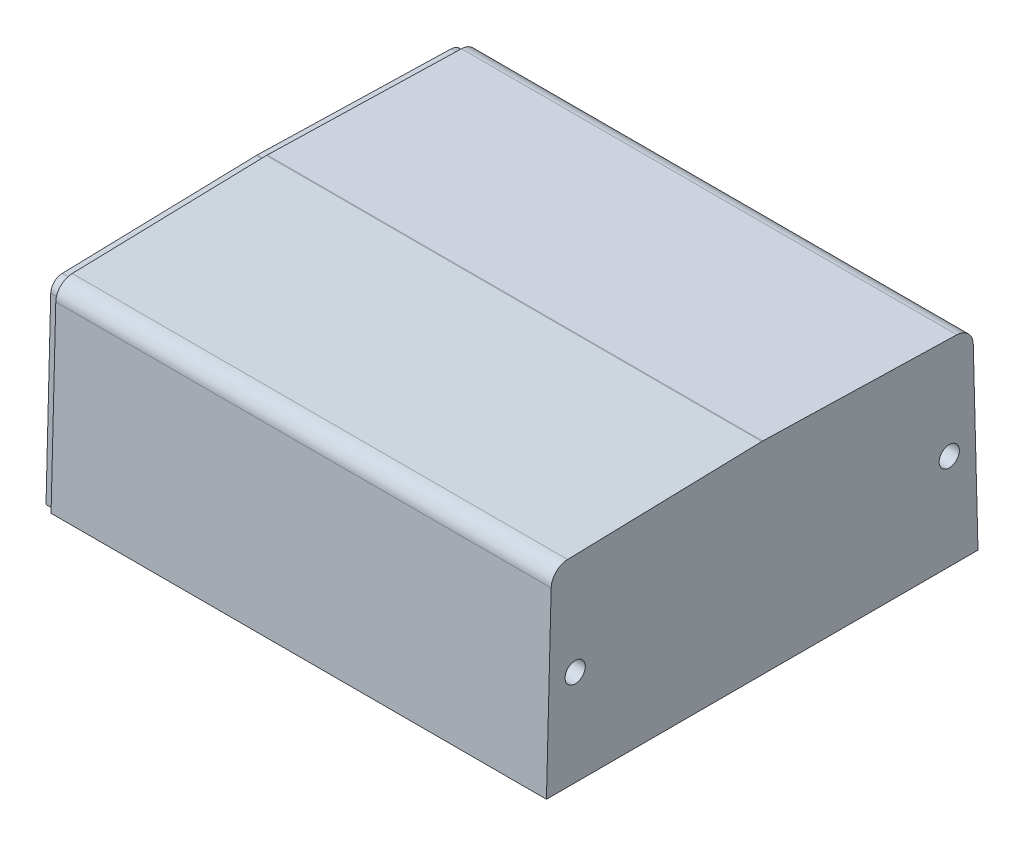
ISO-10303-21;
HEADER;
FILE_DESCRIPTION(('STEP AP214'),'2;1');
FILE_NAME('part.step','',(''),(''),'','','');
FILE_SCHEMA(('AUTOMOTIVE_DESIGN { 1 0 10303 214 1 1 1 1 }'));
ENDSEC;
DATA;
#1=APPLICATION_CONTEXT('core data for automotive mechanical design processes');
#2=APPLICATION_PROTOCOL_DEFINITION('international standard','automotive_design',2000,#1);
#3=PRODUCT_CONTEXT('',#1,'mechanical');
#4=PRODUCT('Part','Part','',(#3));
#5=PRODUCT_RELATED_PRODUCT_CATEGORY('part','',(#4));
#6=PRODUCT_DEFINITION_FORMATION('','',#4);
#7=PRODUCT_DEFINITION_CONTEXT('part definition',#1,'design');
#8=PRODUCT_DEFINITION('design','',#6,#7);
#9=PRODUCT_DEFINITION_SHAPE('','',#8);
#10=(LENGTH_UNIT() NAMED_UNIT(*) SI_UNIT(.MILLI.,.METRE.));
#11=(NAMED_UNIT(*) PLANE_ANGLE_UNIT() SI_UNIT($,.RADIAN.));
#12=(NAMED_UNIT(*) SI_UNIT($,.STERADIAN.) SOLID_ANGLE_UNIT());
#13=UNCERTAINTY_MEASURE_WITH_UNIT(LENGTH_MEASURE(1.E-05),#10,'distance_accuracy_value','');
#14=(GEOMETRIC_REPRESENTATION_CONTEXT(3) GLOBAL_UNCERTAINTY_ASSIGNED_CONTEXT((#13)) GLOBAL_UNIT_ASSIGNED_CONTEXT((#10,
#11,#12)) REPRESENTATION_CONTEXT('',''));
#15=CARTESIAN_POINT('',(0.,0.,0.));
#16=DIRECTION('',(0.,0.,1.));
#17=DIRECTION('',(1.,0.,0.));
#18=AXIS2_PLACEMENT_3D('',#15,#16,#17);
#19=CARTESIAN_POINT('',(67.5,0.,0.));
#20=DIRECTION('',(-1.,0.,0.));
#21=DIRECTION('',(0.,0.,1.));
#22=AXIS2_PLACEMENT_3D('',#19,#20,#21);
#23=PLANE('',#22);
#24=DIRECTION('',(0.,0.866025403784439,0.5));
#25=VECTOR('',#24,1.);
#26=CARTESIAN_POINT('',(67.5,-12.4634,-46.4433756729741));
#27=LINE('',#26,#25);
#28=CARTESIAN_POINT('',(67.5,-12.4634,-46.4433756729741));
#29=VERTEX_POINT('',#28);
#30=CARTESIAN_POINT('',(67.5,-14.9634,-47.8867513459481));
#31=VERTEX_POINT('',#30);
#32=EDGE_CURVE('E594',#29,#31,#27,.F.);
#33=ORIENTED_EDGE('',*,*,#32,.T.);
#34=DIRECTION('',(0.,0.866025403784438,-0.500000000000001));
#35=VECTOR('',#34,1.);
#36=CARTESIAN_POINT('',(67.5,-14.9634,-47.8867513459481));
#37=LINE('',#36,#35);
#38=CARTESIAN_POINT('',(67.5,-17.4634,-46.4433756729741));
#39=VERTEX_POINT('',#38);
#40=EDGE_CURVE('E586',#31,#39,#37,.F.);
#41=ORIENTED_EDGE('',*,*,#40,.T.);
#42=DIRECTION('',(0.,0.,-1.));
#43=VECTOR('',#42,1.);
#44=CARTESIAN_POINT('',(67.5,-17.4634,-46.4433756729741));
#45=LINE('',#44,#43);
#46=CARTESIAN_POINT('',(67.5,-17.4634,-43.556624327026));
#47=VERTEX_POINT('',#46);
#48=EDGE_CURVE('E578',#39,#47,#45,.F.);
#49=ORIENTED_EDGE('',*,*,#48,.T.);
#50=DIRECTION('',(0.,-0.866025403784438,-0.500000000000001));
#51=VECTOR('',#50,1.);
#52=CARTESIAN_POINT('',(67.5,-17.4634,-43.556624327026));
#53=LINE('',#52,#51);
#54=CARTESIAN_POINT('',(67.5,-14.9634,-42.1132486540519));
#55=VERTEX_POINT('',#54);
#56=EDGE_CURVE('E570',#47,#55,#53,.F.);
#57=ORIENTED_EDGE('',*,*,#56,.T.);
#58=DIRECTION('',(0.,-0.866025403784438,0.500000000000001));
#59=VECTOR('',#58,1.);
#60=CARTESIAN_POINT('',(67.5,-14.9634,-42.1132486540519));
#61=LINE('',#60,#59);
#62=CARTESIAN_POINT('',(67.5,-12.4634,-43.556624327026));
#63=VERTEX_POINT('',#62);
#64=EDGE_CURVE('E609',#55,#63,#61,.F.);
#65=ORIENTED_EDGE('',*,*,#64,.T.);
#66=DIRECTION('',(0.,0.,1.));
#67=VECTOR('',#66,1.);
#68=CARTESIAN_POINT('',(67.5,-12.4634,-43.556624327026));
#69=LINE('',#68,#67);
#70=EDGE_CURVE('E601',#63,#29,#69,.F.);
#71=ORIENTED_EDGE('',*,*,#70,.T.);
#72=EDGE_LOOP('',(#33,#41,#49,#57,#65,#71));
#73=FACE_BOUND('',#72,.T.);
#74=ADVANCED_FACE('F15',(#73),#23,.T.);
#75=CARTESIAN_POINT('',(67.5,0.,0.));
#76=DIRECTION('',(-1.,0.,0.));
#77=DIRECTION('',(0.,0.,1.));
#78=AXIS2_PLACEMENT_3D('',#75,#76,#77);
#79=PLANE('',#78);
#80=DIRECTION('',(0.,0.866025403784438,0.500000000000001));
#81=VECTOR('',#80,1.);
#82=CARTESIAN_POINT('',(67.5,-42.4634,-46.4433756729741));
#83=LINE('',#82,#81);
#84=CARTESIAN_POINT('',(67.5,-42.4634,-46.4433756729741));
#85=VERTEX_POINT('',#84);
#86=CARTESIAN_POINT('',(67.5,-44.9634,-47.8867513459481));
#87=VERTEX_POINT('',#86);
#88=EDGE_CURVE('E547',#85,#87,#83,.F.);
#89=ORIENTED_EDGE('',*,*,#88,.T.);
#90=DIRECTION('',(0.,0.866025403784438,-0.500000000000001));
#91=VECTOR('',#90,1.);
#92=CARTESIAN_POINT('',(67.5,-44.9634,-47.8867513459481));
#93=LINE('',#92,#91);
#94=CARTESIAN_POINT('',(67.5,-47.4634,-46.4433756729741));
#95=VERTEX_POINT('',#94);
#96=EDGE_CURVE('E539',#87,#95,#93,.F.);
#97=ORIENTED_EDGE('',*,*,#96,.T.);
#98=DIRECTION('',(0.,0.,-1.));
#99=VECTOR('',#98,1.);
#100=CARTESIAN_POINT('',(67.5,-47.4634,-46.4433756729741));
#101=LINE('',#100,#99);
#102=CARTESIAN_POINT('',(67.5,-47.4634,-43.5566243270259));
#103=VERTEX_POINT('',#102);
#104=EDGE_CURVE('E531',#95,#103,#101,.F.);
#105=ORIENTED_EDGE('',*,*,#104,.T.);
#106=DIRECTION('',(0.,-0.866025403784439,-0.499999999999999));
#107=VECTOR('',#106,1.);
#108=CARTESIAN_POINT('',(67.5,-47.4634,-43.5566243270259));
#109=LINE('',#108,#107);
#110=CARTESIAN_POINT('',(67.5,-44.9634,-42.1132486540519));
#111=VERTEX_POINT('',#110);
#112=EDGE_CURVE('E523',#103,#111,#109,.F.);
#113=ORIENTED_EDGE('',*,*,#112,.T.);
#114=DIRECTION('',(0.,-0.866025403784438,0.500000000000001));
#115=VECTOR('',#114,1.);
#116=CARTESIAN_POINT('',(67.5,-44.9634,-42.1132486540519));
#117=LINE('',#116,#115);
#118=CARTESIAN_POINT('',(67.5,-42.4634,-43.556624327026));
#119=VERTEX_POINT('',#118);
#120=EDGE_CURVE('E563',#111,#119,#117,.F.);
#121=ORIENTED_EDGE('',*,*,#120,.T.);
#122=DIRECTION('',(0.,0.,1.));
#123=VECTOR('',#122,1.);
#124=CARTESIAN_POINT('',(67.5,-42.4634,-43.556624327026));
#125=LINE('',#124,#123);
#126=EDGE_CURVE('E555',#119,#85,#125,.F.);
#127=ORIENTED_EDGE('',*,*,#126,.T.);
#128=EDGE_LOOP('',(#89,#97,#105,#113,#121,#127));
#129=FACE_BOUND('',#128,.T.);
#130=ADVANCED_FACE('F933',(#129),#79,.T.);
#131=CARTESIAN_POINT('',(67.5,0.,0.));
#132=DIRECTION('',(-1.,0.,0.));
#133=DIRECTION('',(0.,0.,1.));
#134=AXIS2_PLACEMENT_3D('',#131,#132,#133);
#135=PLANE('',#134);
#136=DIRECTION('',(0.,0.866025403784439,0.5));
#137=VECTOR('',#136,1.);
#138=CARTESIAN_POINT('',(67.5,-42.4634,43.5566243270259));
#139=LINE('',#138,#137);
#140=CARTESIAN_POINT('',(67.5,-42.4634,43.5566243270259));
#141=VERTEX_POINT('',#140);
#142=CARTESIAN_POINT('',(67.5,-44.9634,42.1132486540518));
#143=VERTEX_POINT('',#142);
#144=EDGE_CURVE('E499',#141,#143,#139,.F.);
#145=ORIENTED_EDGE('',*,*,#144,.T.);
#146=DIRECTION('',(0.,0.866025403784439,-0.499999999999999));
#147=VECTOR('',#146,1.);
#148=CARTESIAN_POINT('',(67.5,-44.9634,42.1132486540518));
#149=LINE('',#148,#147);
#150=CARTESIAN_POINT('',(67.5,-47.4634,43.5566243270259));
#151=VERTEX_POINT('',#150);
#152=EDGE_CURVE('E491',#143,#151,#149,.F.);
#153=ORIENTED_EDGE('',*,*,#152,.T.);
#154=DIRECTION('',(0.,0.,-1.));
#155=VECTOR('',#154,1.);
#156=CARTESIAN_POINT('',(67.5,-47.4634,43.5566243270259));
#157=LINE('',#156,#155);
#158=CARTESIAN_POINT('',(67.5,-47.4634,46.443375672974));
#159=VERTEX_POINT('',#158);
#160=EDGE_CURVE('E483',#151,#159,#157,.F.);
#161=ORIENTED_EDGE('',*,*,#160,.T.);
#162=DIRECTION('',(0.,-0.866025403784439,-0.5));
#163=VECTOR('',#162,1.);
#164=CARTESIAN_POINT('',(67.5,-47.4634,46.443375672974));
#165=LINE('',#164,#163);
#166=CARTESIAN_POINT('',(67.5,-44.9634,47.8867513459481));
#167=VERTEX_POINT('',#166);
#168=EDGE_CURVE('E475',#159,#167,#165,.F.);
#169=ORIENTED_EDGE('',*,*,#168,.T.);
#170=DIRECTION('',(0.,-0.866025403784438,0.500000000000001));
#171=VECTOR('',#170,1.);
#172=CARTESIAN_POINT('',(67.5,-44.9634,47.8867513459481));
#173=LINE('',#172,#171);
#174=CARTESIAN_POINT('',(67.5,-42.4634,46.443375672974));
#175=VERTEX_POINT('',#174);
#176=EDGE_CURVE('E515',#167,#175,#173,.F.);
#177=ORIENTED_EDGE('',*,*,#176,.T.);
#178=DIRECTION('',(0.,0.,1.));
#179=VECTOR('',#178,1.);
#180=CARTESIAN_POINT('',(67.5,-42.4634,46.443375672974));
#181=LINE('',#180,#179);
#182=EDGE_CURVE('E507',#175,#141,#181,.F.);
#183=ORIENTED_EDGE('',*,*,#182,.T.);
#184=EDGE_LOOP('',(#145,#153,#161,#169,#177,#183));
#185=FACE_BOUND('',#184,.T.);
#186=ADVANCED_FACE('F930',(#185),#135,.T.);
#187=CARTESIAN_POINT('',(67.5,0.,0.));
#188=DIRECTION('',(-1.,0.,0.));
#189=DIRECTION('',(0.,0.,1.));
#190=AXIS2_PLACEMENT_3D('',#187,#188,#189);
#191=PLANE('',#190);
#192=DIRECTION('',(0.,0.866025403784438,0.500000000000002));
#193=VECTOR('',#192,1.);
#194=CARTESIAN_POINT('',(67.5,-12.4634,43.5566243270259));
#195=LINE('',#194,#193);
#196=CARTESIAN_POINT('',(67.5,-12.4634,43.5566243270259));
#197=VERTEX_POINT('',#196);
#198=CARTESIAN_POINT('',(67.5,-14.9634,42.1132486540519));
#199=VERTEX_POINT('',#198);
#200=EDGE_CURVE('E451',#197,#199,#195,.F.);
#201=ORIENTED_EDGE('',*,*,#200,.T.);
#202=DIRECTION('',(0.,0.866025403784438,-0.500000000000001));
#203=VECTOR('',#202,1.);
#204=CARTESIAN_POINT('',(67.5,-14.9634,42.1132486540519));
#205=LINE('',#204,#203);
#206=CARTESIAN_POINT('',(67.5,-17.4634,43.5566243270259));
#207=VERTEX_POINT('',#206);
#208=EDGE_CURVE('E443',#199,#207,#205,.F.);
#209=ORIENTED_EDGE('',*,*,#208,.T.);
#210=DIRECTION('',(0.,0.,-1.));
#211=VECTOR('',#210,1.);
#212=CARTESIAN_POINT('',(67.5,-17.4634,43.5566243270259));
#213=LINE('',#212,#211);
#214=CARTESIAN_POINT('',(67.5,-17.4634,46.4433756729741));
#215=VERTEX_POINT('',#214);
#216=EDGE_CURVE('E435',#207,#215,#213,.F.);
#217=ORIENTED_EDGE('',*,*,#216,.T.);
#218=DIRECTION('',(0.,-0.866025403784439,-0.5));
#219=VECTOR('',#218,1.);
#220=CARTESIAN_POINT('',(67.5,-17.4634,46.4433756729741));
#221=LINE('',#220,#219);
#222=CARTESIAN_POINT('',(67.5,-14.9634,47.8867513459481));
#223=VERTEX_POINT('',#222);
#224=EDGE_CURVE('E427',#215,#223,#221,.F.);
#225=ORIENTED_EDGE('',*,*,#224,.T.);
#226=DIRECTION('',(0.,-0.866025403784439,0.499999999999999));
#227=VECTOR('',#226,1.);
#228=CARTESIAN_POINT('',(67.5,-14.9634,47.8867513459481));
#229=LINE('',#228,#227);
#230=CARTESIAN_POINT('',(67.5,-12.4634,46.443375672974));
#231=VERTEX_POINT('',#230);
#232=EDGE_CURVE('E467',#223,#231,#229,.F.);
#233=ORIENTED_EDGE('',*,*,#232,.T.);
#234=DIRECTION('',(0.,0.,1.));
#235=VECTOR('',#234,1.);
#236=CARTESIAN_POINT('',(67.5,-12.4634,46.4433756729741));
#237=LINE('',#236,#235);
#238=EDGE_CURVE('E459',#231,#197,#237,.F.);
#239=ORIENTED_EDGE('',*,*,#238,.T.);
#240=EDGE_LOOP('',(#201,#209,#217,#225,#233,#239));
#241=FACE_BOUND('',#240,.T.);
#242=ADVANCED_FACE('F926',(#241),#191,.T.);
#243=CARTESIAN_POINT('',(67.5,-14.9634,-42.1132486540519));
#244=DIRECTION('',(0.,0.500000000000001,0.866025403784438));
#245=DIRECTION('',(0.,-0.866025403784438,0.500000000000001));
#246=AXIS2_PLACEMENT_3D('',#243,#244,#245);
#247=PLANE('',#246);
#248=DIRECTION('',(1.,0.,0.));
#249=VECTOR('',#248,1.);
#250=CARTESIAN_POINT('',(67.5,-12.4634,-43.556624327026));
#251=LINE('',#250,#249);
#252=CARTESIAN_POINT('',(64.5,-12.4634,-43.556624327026));
#253=VERTEX_POINT('',#252);
#254=EDGE_CURVE('E605',#253,#63,#251,.T.);
#255=ORIENTED_EDGE('',*,*,#254,.T.);
#256=ORIENTED_EDGE('',*,*,#64,.F.);
#257=DIRECTION('',(1.,0.,0.));
#258=VECTOR('',#257,1.);
#259=CARTESIAN_POINT('',(67.5,-14.9634,-42.1132486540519));
#260=LINE('',#259,#258);
#261=CARTESIAN_POINT('',(64.5,-14.9634,-42.1132486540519));
#262=VERTEX_POINT('',#261);
#263=EDGE_CURVE('E567',#55,#262,#260,.F.);
#264=ORIENTED_EDGE('',*,*,#263,.T.);
#265=DIRECTION('',(0.,0.866025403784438,-0.500000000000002));
#266=VECTOR('',#265,1.);
#267=CARTESIAN_POINT('',(64.5,-14.9634,-42.1132486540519));
#268=LINE('',#267,#266);
#269=EDGE_CURVE('E420',#262,#253,#268,.T.);
#270=ORIENTED_EDGE('',*,*,#269,.T.);
#271=EDGE_LOOP('',(#255,#256,#264,#270));
#272=FACE_BOUND('',#271,.T.);
#273=ADVANCED_FACE('F922',(#272),#247,.F.);
#274=CARTESIAN_POINT('',(67.5,-12.4634,-43.556624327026));
#275=DIRECTION('',(0.,1.,0.));
#276=DIRECTION('',(0.,0.,1.));
#277=AXIS2_PLACEMENT_3D('',#274,#275,#276);
#278=PLANE('',#277);
#279=DIRECTION('',(1.,0.,0.));
#280=VECTOR('',#279,1.);
#281=CARTESIAN_POINT('',(67.5,-12.4634,-46.4433756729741));
#282=LINE('',#281,#280);
#283=CARTESIAN_POINT('',(64.5,-12.4634,-46.4433756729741));
#284=VERTEX_POINT('',#283);
#285=EDGE_CURVE('E598',#284,#29,#282,.T.);
#286=ORIENTED_EDGE('',*,*,#285,.T.);
#287=ORIENTED_EDGE('',*,*,#70,.F.);
#288=ORIENTED_EDGE('',*,*,#254,.F.);
#289=DIRECTION('',(0.,0.,-1.));
#290=VECTOR('',#289,1.);
#291=CARTESIAN_POINT('',(64.5,-12.4634,-45.));
#292=LINE('',#291,#290);
#293=EDGE_CURVE('E417',#253,#284,#292,.T.);
#294=ORIENTED_EDGE('',*,*,#293,.T.);
#295=EDGE_LOOP('',(#286,#287,#288,#294));
#296=FACE_BOUND('',#295,.T.);
#297=ADVANCED_FACE('F918',(#296),#278,.F.);
#298=CARTESIAN_POINT('',(67.5,-12.4634,-46.4433756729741));
#299=DIRECTION('',(0.,0.5,-0.866025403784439));
#300=DIRECTION('',(0.,0.866025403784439,0.5));
#301=AXIS2_PLACEMENT_3D('',#298,#299,#300);
#302=PLANE('',#301);
#303=DIRECTION('',(1.,0.,0.));
#304=VECTOR('',#303,1.);
#305=CARTESIAN_POINT('',(67.5,-14.9634,-47.8867513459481));
#306=LINE('',#305,#304);
#307=CARTESIAN_POINT('',(64.5,-14.9634,-47.8867513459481));
#308=VERTEX_POINT('',#307);
#309=EDGE_CURVE('E590',#308,#31,#306,.T.);
#310=ORIENTED_EDGE('',*,*,#309,.T.);
#311=ORIENTED_EDGE('',*,*,#32,.F.);
#312=ORIENTED_EDGE('',*,*,#285,.F.);
#313=DIRECTION('',(0.,-0.86602540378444,-0.499999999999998));
#314=VECTOR('',#313,1.);
#315=CARTESIAN_POINT('',(64.5,-12.4634,-46.4433756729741));
#316=LINE('',#315,#314);
#317=EDGE_CURVE('E414',#284,#308,#316,.T.);
#318=ORIENTED_EDGE('',*,*,#317,.T.);
#319=EDGE_LOOP('',(#310,#311,#312,#318));
#320=FACE_BOUND('',#319,.T.);
#321=ADVANCED_FACE('F914',(#320),#302,.F.);
#322=CARTESIAN_POINT('',(67.5,-14.9634,-47.8867513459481));
#323=DIRECTION('',(0.,-0.500000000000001,-0.866025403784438));
#324=DIRECTION('',(0.,0.866025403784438,-0.500000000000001));
#325=AXIS2_PLACEMENT_3D('',#322,#323,#324);
#326=PLANE('',#325);
#327=DIRECTION('',(1.,0.,0.));
#328=VECTOR('',#327,1.);
#329=CARTESIAN_POINT('',(67.5,-17.4634,-46.4433756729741));
#330=LINE('',#329,#328);
#331=CARTESIAN_POINT('',(64.5,-17.4634,-46.4433756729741));
#332=VERTEX_POINT('',#331);
#333=EDGE_CURVE('E582',#332,#39,#330,.T.);
#334=ORIENTED_EDGE('',*,*,#333,.T.);
#335=ORIENTED_EDGE('',*,*,#40,.F.);
#336=ORIENTED_EDGE('',*,*,#309,.F.);
#337=DIRECTION('',(0.,-0.866025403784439,0.499999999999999));
#338=VECTOR('',#337,1.);
#339=CARTESIAN_POINT('',(64.5,-14.9634,-47.8867513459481));
#340=LINE('',#339,#338);
#341=EDGE_CURVE('E410',#308,#332,#340,.T.);
#342=ORIENTED_EDGE('',*,*,#341,.T.);
#343=EDGE_LOOP('',(#334,#335,#336,#342));
#344=FACE_BOUND('',#343,.T.);
#345=ADVANCED_FACE('F910',(#344),#326,.F.);
#346=CARTESIAN_POINT('',(67.5,-17.4634,-46.4433756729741));
#347=DIRECTION('',(0.,-1.,0.));
#348=DIRECTION('',(0.,0.,-1.));
#349=AXIS2_PLACEMENT_3D('',#346,#347,#348);
#350=PLANE('',#349);
#351=DIRECTION('',(1.,0.,0.));
#352=VECTOR('',#351,1.);
#353=CARTESIAN_POINT('',(67.5,-17.4634,-43.556624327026));
#354=LINE('',#353,#352);
#355=CARTESIAN_POINT('',(64.5,-17.4634,-43.556624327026));
#356=VERTEX_POINT('',#355);
#357=EDGE_CURVE('E574',#356,#47,#354,.T.);
#358=ORIENTED_EDGE('',*,*,#357,.T.);
#359=ORIENTED_EDGE('',*,*,#48,.F.);
#360=ORIENTED_EDGE('',*,*,#333,.F.);
#361=DIRECTION('',(0.,0.,-1.));
#362=VECTOR('',#361,1.);
#363=CARTESIAN_POINT('',(64.5,-17.4634,-45.));
#364=LINE('',#363,#362);
#365=EDGE_CURVE('E406',#332,#356,#364,.F.);
#366=ORIENTED_EDGE('',*,*,#365,.T.);
#367=EDGE_LOOP('',(#358,#359,#360,#366));
#368=FACE_BOUND('',#367,.T.);
#369=ADVANCED_FACE('F906',(#368),#350,.F.);
#370=CARTESIAN_POINT('',(67.5,-17.4634,-43.556624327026));
#371=DIRECTION('',(0.,-0.500000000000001,0.866025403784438));
#372=DIRECTION('',(0.,-0.866025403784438,-0.500000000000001));
#373=AXIS2_PLACEMENT_3D('',#370,#371,#372);
#374=PLANE('',#373);
#375=ORIENTED_EDGE('',*,*,#263,.F.);
#376=ORIENTED_EDGE('',*,*,#56,.F.);
#377=ORIENTED_EDGE('',*,*,#357,.F.);
#378=DIRECTION('',(0.,0.866025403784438,0.500000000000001));
#379=VECTOR('',#378,1.);
#380=CARTESIAN_POINT('',(64.5,-17.4634,-43.556624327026));
#381=LINE('',#380,#379);
#382=EDGE_CURVE('E403',#356,#262,#381,.T.);
#383=ORIENTED_EDGE('',*,*,#382,.T.);
#384=EDGE_LOOP('',(#375,#376,#377,#383));
#385=FACE_BOUND('',#384,.T.);
#386=ADVANCED_FACE('F902',(#385),#374,.F.);
#387=CARTESIAN_POINT('',(67.5,-44.9634,-42.1132486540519));
#388=DIRECTION('',(0.,0.500000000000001,0.866025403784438));
#389=DIRECTION('',(0.,-0.866025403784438,0.500000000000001));
#390=AXIS2_PLACEMENT_3D('',#387,#388,#389);
#391=PLANE('',#390);
#392=DIRECTION('',(1.,0.,0.));
#393=VECTOR('',#392,1.);
#394=CARTESIAN_POINT('',(67.5,-42.4634,-43.556624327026));
#395=LINE('',#394,#393);
#396=CARTESIAN_POINT('',(64.5,-42.4634,-43.556624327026));
#397=VERTEX_POINT('',#396);
#398=EDGE_CURVE('E559',#397,#119,#395,.T.);
#399=ORIENTED_EDGE('',*,*,#398,.T.);
#400=ORIENTED_EDGE('',*,*,#120,.F.);
#401=DIRECTION('',(1.,0.,0.));
#402=VECTOR('',#401,1.);
#403=CARTESIAN_POINT('',(67.5,-44.9634,-42.1132486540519));
#404=LINE('',#403,#402);
#405=CARTESIAN_POINT('',(64.5,-44.9634,-42.1132486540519));
#406=VERTEX_POINT('',#405);
#407=EDGE_CURVE('E519',#111,#406,#404,.F.);
#408=ORIENTED_EDGE('',*,*,#407,.T.);
#409=DIRECTION('',(0.,0.866025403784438,-0.500000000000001));
#410=VECTOR('',#409,1.);
#411=CARTESIAN_POINT('',(64.5,-44.9634,-42.1132486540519));
#412=LINE('',#411,#410);
#413=EDGE_CURVE('E399',#406,#397,#412,.T.);
#414=ORIENTED_EDGE('',*,*,#413,.T.);
#415=EDGE_LOOP('',(#399,#400,#408,#414));
#416=FACE_BOUND('',#415,.T.);
#417=ADVANCED_FACE('F898',(#416),#391,.F.);
#418=CARTESIAN_POINT('',(67.5,-42.4634,-43.556624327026));
#419=DIRECTION('',(0.,1.,0.));
#420=DIRECTION('',(0.,0.,1.));
#421=AXIS2_PLACEMENT_3D('',#418,#419,#420);
#422=PLANE('',#421);
#423=DIRECTION('',(1.,0.,0.));
#424=VECTOR('',#423,1.);
#425=CARTESIAN_POINT('',(67.5,-42.4634,-46.4433756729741));
#426=LINE('',#425,#424);
#427=CARTESIAN_POINT('',(64.5,-42.4634,-46.4433756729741));
#428=VERTEX_POINT('',#427);
#429=EDGE_CURVE('E551',#428,#85,#426,.T.);
#430=ORIENTED_EDGE('',*,*,#429,.T.);
#431=ORIENTED_EDGE('',*,*,#126,.F.);
#432=ORIENTED_EDGE('',*,*,#398,.F.);
#433=DIRECTION('',(0.,0.,-1.));
#434=VECTOR('',#433,1.);
#435=CARTESIAN_POINT('',(64.5,-42.4634,-45.));
#436=LINE('',#435,#434);
#437=EDGE_CURVE('E395',#397,#428,#436,.T.);
#438=ORIENTED_EDGE('',*,*,#437,.T.);
#439=EDGE_LOOP('',(#430,#431,#432,#438));
#440=FACE_BOUND('',#439,.T.);
#441=ADVANCED_FACE('F894',(#440),#422,.F.);
#442=CARTESIAN_POINT('',(67.5,-42.4634,-46.4433756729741));
#443=DIRECTION('',(0.,0.500000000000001,-0.866025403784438));
#444=DIRECTION('',(0.,0.866025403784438,0.500000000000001));
#445=AXIS2_PLACEMENT_3D('',#442,#443,#444);
#446=PLANE('',#445);
#447=DIRECTION('',(1.,0.,0.));
#448=VECTOR('',#447,1.);
#449=CARTESIAN_POINT('',(67.5,-44.9634,-47.8867513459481));
#450=LINE('',#449,#448);
#451=CARTESIAN_POINT('',(64.5,-44.9634,-47.8867513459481));
#452=VERTEX_POINT('',#451);
#453=EDGE_CURVE('E543',#452,#87,#450,.T.);
#454=ORIENTED_EDGE('',*,*,#453,.T.);
#455=ORIENTED_EDGE('',*,*,#88,.F.);
#456=ORIENTED_EDGE('',*,*,#429,.F.);
#457=DIRECTION('',(0.,-0.866025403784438,-0.500000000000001));
#458=VECTOR('',#457,1.);
#459=CARTESIAN_POINT('',(64.5,-42.4634,-46.4433756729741));
#460=LINE('',#459,#458);
#461=EDGE_CURVE('E391',#428,#452,#460,.T.);
#462=ORIENTED_EDGE('',*,*,#461,.T.);
#463=EDGE_LOOP('',(#454,#455,#456,#462));
#464=FACE_BOUND('',#463,.T.);
#465=ADVANCED_FACE('F890',(#464),#446,.F.);
#466=CARTESIAN_POINT('',(67.5,-44.9634,-47.8867513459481));
#467=DIRECTION('',(0.,-0.500000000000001,-0.866025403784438));
#468=DIRECTION('',(0.,0.866025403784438,-0.500000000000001));
#469=AXIS2_PLACEMENT_3D('',#466,#467,#468);
#470=PLANE('',#469);
#471=DIRECTION('',(1.,0.,0.));
#472=VECTOR('',#471,1.);
#473=CARTESIAN_POINT('',(67.5,-47.4634,-46.4433756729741));
#474=LINE('',#473,#472);
#475=CARTESIAN_POINT('',(64.5,-47.4634,-46.4433756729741));
#476=VERTEX_POINT('',#475);
#477=EDGE_CURVE('E535',#476,#95,#474,.T.);
#478=ORIENTED_EDGE('',*,*,#477,.T.);
#479=ORIENTED_EDGE('',*,*,#96,.F.);
#480=ORIENTED_EDGE('',*,*,#453,.F.);
#481=DIRECTION('',(0.,-0.866025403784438,0.500000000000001));
#482=VECTOR('',#481,1.);
#483=CARTESIAN_POINT('',(64.5,-44.9634,-47.8867513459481));
#484=LINE('',#483,#482);
#485=EDGE_CURVE('E387',#452,#476,#484,.T.);
#486=ORIENTED_EDGE('',*,*,#485,.T.);
#487=EDGE_LOOP('',(#478,#479,#480,#486));
#488=FACE_BOUND('',#487,.T.);
#489=ADVANCED_FACE('F886',(#488),#470,.F.);
#490=CARTESIAN_POINT('',(67.5,-47.4634,-46.4433756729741));
#491=DIRECTION('',(0.,-1.,0.));
#492=DIRECTION('',(0.,0.,-1.));
#493=AXIS2_PLACEMENT_3D('',#490,#491,#492);
#494=PLANE('',#493);
#495=DIRECTION('',(1.,0.,0.));
#496=VECTOR('',#495,1.);
#497=CARTESIAN_POINT('',(67.5,-47.4634,-43.5566243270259));
#498=LINE('',#497,#496);
#499=CARTESIAN_POINT('',(64.5,-47.4634,-43.556624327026));
#500=VERTEX_POINT('',#499);
#501=EDGE_CURVE('E527',#500,#103,#498,.T.);
#502=ORIENTED_EDGE('',*,*,#501,.T.);
#503=ORIENTED_EDGE('',*,*,#104,.F.);
#504=ORIENTED_EDGE('',*,*,#477,.F.);
#505=DIRECTION('',(0.,0.,-1.));
#506=VECTOR('',#505,1.);
#507=CARTESIAN_POINT('',(64.5,-47.4634,-45.));
#508=LINE('',#507,#506);
#509=EDGE_CURVE('E383',#476,#500,#508,.F.);
#510=ORIENTED_EDGE('',*,*,#509,.T.);
#511=EDGE_LOOP('',(#502,#503,#504,#510));
#512=FACE_BOUND('',#511,.T.);
#513=ADVANCED_FACE('F882',(#512),#494,.F.);
#514=CARTESIAN_POINT('',(67.5,-47.4634,-43.5566243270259));
#515=DIRECTION('',(0.,-0.499999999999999,0.866025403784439));
#516=DIRECTION('',(0.,-0.866025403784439,-0.499999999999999));
#517=AXIS2_PLACEMENT_3D('',#514,#515,#516);
#518=PLANE('',#517);
#519=ORIENTED_EDGE('',*,*,#407,.F.);
#520=ORIENTED_EDGE('',*,*,#112,.F.);
#521=ORIENTED_EDGE('',*,*,#501,.F.);
#522=DIRECTION('',(0.,0.866025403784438,0.500000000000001));
#523=VECTOR('',#522,1.);
#524=CARTESIAN_POINT('',(64.5,-47.4634,-43.556624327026));
#525=LINE('',#524,#523);
#526=EDGE_CURVE('E379',#500,#406,#525,.T.);
#527=ORIENTED_EDGE('',*,*,#526,.T.);
#528=EDGE_LOOP('',(#519,#520,#521,#527));
#529=FACE_BOUND('',#528,.T.);
#530=ADVANCED_FACE('F878',(#529),#518,.F.);
#531=CARTESIAN_POINT('',(67.5,-44.9634,47.8867513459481));
#532=DIRECTION('',(0.,0.500000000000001,0.866025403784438));
#533=DIRECTION('',(0.,-0.866025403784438,0.500000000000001));
#534=AXIS2_PLACEMENT_3D('',#531,#532,#533);
#535=PLANE('',#534);
#536=DIRECTION('',(1.,0.,0.));
#537=VECTOR('',#536,1.);
#538=CARTESIAN_POINT('',(67.5,-42.4634,46.443375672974));
#539=LINE('',#538,#537);
#540=CARTESIAN_POINT('',(64.5,-42.4634,46.443375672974));
#541=VERTEX_POINT('',#540);
#542=EDGE_CURVE('E511',#541,#175,#539,.T.);
#543=ORIENTED_EDGE('',*,*,#542,.T.);
#544=ORIENTED_EDGE('',*,*,#176,.F.);
#545=DIRECTION('',(1.,0.,0.));
#546=VECTOR('',#545,1.);
#547=CARTESIAN_POINT('',(67.5,-44.9634,47.8867513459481));
#548=LINE('',#547,#546);
#549=CARTESIAN_POINT('',(64.5,-44.9634,47.8867513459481));
#550=VERTEX_POINT('',#549);
#551=EDGE_CURVE('E471',#167,#550,#548,.F.);
#552=ORIENTED_EDGE('',*,*,#551,.T.);
#553=DIRECTION('',(0.,0.866025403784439,-0.499999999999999));
#554=VECTOR('',#553,1.);
#555=CARTESIAN_POINT('',(64.5,-44.9634,47.8867513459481));
#556=LINE('',#555,#554);
#557=EDGE_CURVE('E375',#550,#541,#556,.T.);
#558=ORIENTED_EDGE('',*,*,#557,.T.);
#559=EDGE_LOOP('',(#543,#544,#552,#558));
#560=FACE_BOUND('',#559,.T.);
#561=ADVANCED_FACE('F874',(#560),#535,.F.);
#562=CARTESIAN_POINT('',(67.5,-42.4634,46.443375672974));
#563=DIRECTION('',(0.,1.,0.));
#564=DIRECTION('',(0.,0.,1.));
#565=AXIS2_PLACEMENT_3D('',#562,#563,#564);
#566=PLANE('',#565);
#567=DIRECTION('',(1.,0.,0.));
#568=VECTOR('',#567,1.);
#569=CARTESIAN_POINT('',(67.5,-42.4634,43.5566243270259));
#570=LINE('',#569,#568);
#571=CARTESIAN_POINT('',(64.5,-42.4634,43.5566243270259));
#572=VERTEX_POINT('',#571);
#573=EDGE_CURVE('E503',#572,#141,#570,.T.);
#574=ORIENTED_EDGE('',*,*,#573,.T.);
#575=ORIENTED_EDGE('',*,*,#182,.F.);
#576=ORIENTED_EDGE('',*,*,#542,.F.);
#577=DIRECTION('',(0.,0.,-1.));
#578=VECTOR('',#577,1.);
#579=CARTESIAN_POINT('',(64.5,-42.4634,45.));
#580=LINE('',#579,#578);
#581=EDGE_CURVE('E371',#541,#572,#580,.T.);
#582=ORIENTED_EDGE('',*,*,#581,.T.);
#583=EDGE_LOOP('',(#574,#575,#576,#582));
#584=FACE_BOUND('',#583,.T.);
#585=ADVANCED_FACE('F870',(#584),#566,.F.);
#586=CARTESIAN_POINT('',(67.5,-42.4634,43.5566243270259));
#587=DIRECTION('',(0.,0.5,-0.866025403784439));
#588=DIRECTION('',(0.,0.866025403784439,0.5));
#589=AXIS2_PLACEMENT_3D('',#586,#587,#588);
#590=PLANE('',#589);
#591=DIRECTION('',(1.,0.,0.));
#592=VECTOR('',#591,1.);
#593=CARTESIAN_POINT('',(67.5,-44.9634,42.1132486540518));
#594=LINE('',#593,#592);
#595=CARTESIAN_POINT('',(64.5,-44.9634,42.1132486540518));
#596=VERTEX_POINT('',#595);
#597=EDGE_CURVE('E495',#596,#143,#594,.T.);
#598=ORIENTED_EDGE('',*,*,#597,.T.);
#599=ORIENTED_EDGE('',*,*,#144,.F.);
#600=ORIENTED_EDGE('',*,*,#573,.F.);
#601=DIRECTION('',(0.,-0.866025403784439,-0.5));
#602=VECTOR('',#601,1.);
#603=CARTESIAN_POINT('',(64.5,-42.4634,43.5566243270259));
#604=LINE('',#603,#602);
#605=EDGE_CURVE('E367',#572,#596,#604,.T.);
#606=ORIENTED_EDGE('',*,*,#605,.T.);
#607=EDGE_LOOP('',(#598,#599,#600,#606));
#608=FACE_BOUND('',#607,.T.);
#609=ADVANCED_FACE('F866',(#608),#590,.F.);
#610=CARTESIAN_POINT('',(67.5,-44.9634,42.1132486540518));
#611=DIRECTION('',(0.,-0.499999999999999,-0.866025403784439));
#612=DIRECTION('',(0.,0.866025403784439,-0.499999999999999));
#613=AXIS2_PLACEMENT_3D('',#610,#611,#612);
#614=PLANE('',#613);
#615=DIRECTION('',(1.,0.,0.));
#616=VECTOR('',#615,1.);
#617=CARTESIAN_POINT('',(67.5,-47.4634,43.5566243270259));
#618=LINE('',#617,#616);
#619=CARTESIAN_POINT('',(64.5,-47.4634,43.5566243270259));
#620=VERTEX_POINT('',#619);
#621=EDGE_CURVE('E487',#620,#151,#618,.T.);
#622=ORIENTED_EDGE('',*,*,#621,.T.);
#623=ORIENTED_EDGE('',*,*,#152,.F.);
#624=ORIENTED_EDGE('',*,*,#597,.F.);
#625=DIRECTION('',(0.,-0.866025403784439,0.499999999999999));
#626=VECTOR('',#625,1.);
#627=CARTESIAN_POINT('',(64.5,-44.9634,42.1132486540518));
#628=LINE('',#627,#626);
#629=EDGE_CURVE('E363',#596,#620,#628,.T.);
#630=ORIENTED_EDGE('',*,*,#629,.T.);
#631=EDGE_LOOP('',(#622,#623,#624,#630));
#632=FACE_BOUND('',#631,.T.);
#633=ADVANCED_FACE('F862',(#632),#614,.F.);
#634=CARTESIAN_POINT('',(67.5,-47.4634,43.5566243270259));
#635=DIRECTION('',(0.,-1.,0.));
#636=DIRECTION('',(0.,0.,-1.));
#637=AXIS2_PLACEMENT_3D('',#634,#635,#636);
#638=PLANE('',#637);
#639=DIRECTION('',(1.,0.,0.));
#640=VECTOR('',#639,1.);
#641=CARTESIAN_POINT('',(67.5,-47.4634,46.443375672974));
#642=LINE('',#641,#640);
#643=CARTESIAN_POINT('',(64.5,-47.4634,46.443375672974));
#644=VERTEX_POINT('',#643);
#645=EDGE_CURVE('E479',#644,#159,#642,.T.);
#646=ORIENTED_EDGE('',*,*,#645,.T.);
#647=ORIENTED_EDGE('',*,*,#160,.F.);
#648=ORIENTED_EDGE('',*,*,#621,.F.);
#649=DIRECTION('',(0.,0.,-1.));
#650=VECTOR('',#649,1.);
#651=CARTESIAN_POINT('',(64.5,-47.4634,45.));
#652=LINE('',#651,#650);
#653=EDGE_CURVE('E359',#620,#644,#652,.F.);
#654=ORIENTED_EDGE('',*,*,#653,.T.);
#655=EDGE_LOOP('',(#646,#647,#648,#654));
#656=FACE_BOUND('',#655,.T.);
#657=ADVANCED_FACE('F858',(#656),#638,.F.);
#658=CARTESIAN_POINT('',(67.5,-47.4634,46.443375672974));
#659=DIRECTION('',(0.,-0.5,0.866025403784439));
#660=DIRECTION('',(0.,-0.866025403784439,-0.5));
#661=AXIS2_PLACEMENT_3D('',#658,#659,#660);
#662=PLANE('',#661);
#663=ORIENTED_EDGE('',*,*,#551,.F.);
#664=ORIENTED_EDGE('',*,*,#168,.F.);
#665=ORIENTED_EDGE('',*,*,#645,.F.);
#666=DIRECTION('',(0.,0.86602540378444,0.499999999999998));
#667=VECTOR('',#666,1.);
#668=CARTESIAN_POINT('',(64.5,-47.4634,46.443375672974));
#669=LINE('',#668,#667);
#670=EDGE_CURVE('E355',#644,#550,#669,.T.);
#671=ORIENTED_EDGE('',*,*,#670,.T.);
#672=EDGE_LOOP('',(#663,#664,#665,#671));
#673=FACE_BOUND('',#672,.T.);
#674=ADVANCED_FACE('F854',(#673),#662,.F.);
#675=CARTESIAN_POINT('',(67.5,-14.9634,47.8867513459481));
#676=DIRECTION('',(0.,0.499999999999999,0.866025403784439));
#677=DIRECTION('',(0.,-0.866025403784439,0.499999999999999));
#678=AXIS2_PLACEMENT_3D('',#675,#676,#677);
#679=PLANE('',#678);
#680=DIRECTION('',(1.,0.,0.));
#681=VECTOR('',#680,1.);
#682=CARTESIAN_POINT('',(67.5,-12.4634,46.4433756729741));
#683=LINE('',#682,#681);
#684=CARTESIAN_POINT('',(64.5,-12.4634,46.443375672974));
#685=VERTEX_POINT('',#684);
#686=EDGE_CURVE('E463',#685,#231,#683,.T.);
#687=ORIENTED_EDGE('',*,*,#686,.T.);
#688=ORIENTED_EDGE('',*,*,#232,.F.);
#689=DIRECTION('',(1.,0.,0.));
#690=VECTOR('',#689,1.);
#691=CARTESIAN_POINT('',(67.5,-14.9634,47.8867513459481));
#692=LINE('',#691,#690);
#693=CARTESIAN_POINT('',(64.5,-14.9634,47.8867513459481));
#694=VERTEX_POINT('',#693);
#695=EDGE_CURVE('E423',#223,#694,#692,.F.);
#696=ORIENTED_EDGE('',*,*,#695,.T.);
#697=DIRECTION('',(0.,0.86602540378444,-0.499999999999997));
#698=VECTOR('',#697,1.);
#699=CARTESIAN_POINT('',(64.5,-14.9634,47.8867513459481));
#700=LINE('',#699,#698);
#701=EDGE_CURVE('E351',#694,#685,#700,.T.);
#702=ORIENTED_EDGE('',*,*,#701,.T.);
#703=EDGE_LOOP('',(#687,#688,#696,#702));
#704=FACE_BOUND('',#703,.T.);
#705=ADVANCED_FACE('F850',(#704),#679,.F.);
#706=CARTESIAN_POINT('',(67.5,-12.4634,46.4433756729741));
#707=DIRECTION('',(0.,1.,0.));
#708=DIRECTION('',(0.,0.,1.));
#709=AXIS2_PLACEMENT_3D('',#706,#707,#708);
#710=PLANE('',#709);
#711=DIRECTION('',(1.,0.,0.));
#712=VECTOR('',#711,1.);
#713=CARTESIAN_POINT('',(67.5,-12.4634,43.5566243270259));
#714=LINE('',#713,#712);
#715=CARTESIAN_POINT('',(64.5,-12.4634,43.5566243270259));
#716=VERTEX_POINT('',#715);
#717=EDGE_CURVE('E455',#716,#197,#714,.T.);
#718=ORIENTED_EDGE('',*,*,#717,.T.);
#719=ORIENTED_EDGE('',*,*,#238,.F.);
#720=ORIENTED_EDGE('',*,*,#686,.F.);
#721=DIRECTION('',(0.,0.,-1.));
#722=VECTOR('',#721,1.);
#723=CARTESIAN_POINT('',(64.5,-12.4634,45.));
#724=LINE('',#723,#722);
#725=EDGE_CURVE('E347',#685,#716,#724,.T.);
#726=ORIENTED_EDGE('',*,*,#725,.T.);
#727=EDGE_LOOP('',(#718,#719,#720,#726));
#728=FACE_BOUND('',#727,.T.);
#729=ADVANCED_FACE('F846',(#728),#710,.F.);
#730=CARTESIAN_POINT('',(67.5,-12.4634,43.5566243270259));
#731=DIRECTION('',(0.,0.500000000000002,-0.866025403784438));
#732=DIRECTION('',(0.,0.866025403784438,0.500000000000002));
#733=AXIS2_PLACEMENT_3D('',#730,#731,#732);
#734=PLANE('',#733);
#735=DIRECTION('',(1.,0.,0.));
#736=VECTOR('',#735,1.);
#737=CARTESIAN_POINT('',(67.5,-14.9634,42.1132486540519));
#738=LINE('',#737,#736);
#739=CARTESIAN_POINT('',(64.5,-14.9634,42.1132486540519));
#740=VERTEX_POINT('',#739);
#741=EDGE_CURVE('E447',#740,#199,#738,.T.);
#742=ORIENTED_EDGE('',*,*,#741,.T.);
#743=ORIENTED_EDGE('',*,*,#200,.F.);
#744=ORIENTED_EDGE('',*,*,#717,.F.);
#745=DIRECTION('',(0.,-0.866025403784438,-0.500000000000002));
#746=VECTOR('',#745,1.);
#747=CARTESIAN_POINT('',(64.5,-12.4634,43.5566243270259));
#748=LINE('',#747,#746);
#749=EDGE_CURVE('E343',#716,#740,#748,.T.);
#750=ORIENTED_EDGE('',*,*,#749,.T.);
#751=EDGE_LOOP('',(#742,#743,#744,#750));
#752=FACE_BOUND('',#751,.T.);
#753=ADVANCED_FACE('F842',(#752),#734,.F.);
#754=CARTESIAN_POINT('',(67.5,-14.9634,42.1132486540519));
#755=DIRECTION('',(0.,-0.500000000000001,-0.866025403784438));
#756=DIRECTION('',(0.,0.866025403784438,-0.500000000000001));
#757=AXIS2_PLACEMENT_3D('',#754,#755,#756);
#758=PLANE('',#757);
#759=DIRECTION('',(1.,0.,0.));
#760=VECTOR('',#759,1.);
#761=CARTESIAN_POINT('',(67.5,-17.4634,43.5566243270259));
#762=LINE('',#761,#760);
#763=CARTESIAN_POINT('',(64.5,-17.4634,43.5566243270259));
#764=VERTEX_POINT('',#763);
#765=EDGE_CURVE('E439',#764,#207,#762,.T.);
#766=ORIENTED_EDGE('',*,*,#765,.T.);
#767=ORIENTED_EDGE('',*,*,#208,.F.);
#768=ORIENTED_EDGE('',*,*,#741,.F.);
#769=DIRECTION('',(0.,-0.866025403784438,0.500000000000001));
#770=VECTOR('',#769,1.);
#771=CARTESIAN_POINT('',(64.5,-14.9634,42.1132486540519));
#772=LINE('',#771,#770);
#773=EDGE_CURVE('E339',#740,#764,#772,.T.);
#774=ORIENTED_EDGE('',*,*,#773,.T.);
#775=EDGE_LOOP('',(#766,#767,#768,#774));
#776=FACE_BOUND('',#775,.T.);
#777=ADVANCED_FACE('F838',(#776),#758,.F.);
#778=CARTESIAN_POINT('',(67.5,-17.4634,43.5566243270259));
#779=DIRECTION('',(0.,-1.,0.));
#780=DIRECTION('',(0.,0.,-1.));
#781=AXIS2_PLACEMENT_3D('',#778,#779,#780);
#782=PLANE('',#781);
#783=DIRECTION('',(1.,0.,0.));
#784=VECTOR('',#783,1.);
#785=CARTESIAN_POINT('',(67.5,-17.4634,46.4433756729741));
#786=LINE('',#785,#784);
#787=CARTESIAN_POINT('',(64.5,-17.4634,46.4433756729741));
#788=VERTEX_POINT('',#787);
#789=EDGE_CURVE('E431',#788,#215,#786,.T.);
#790=ORIENTED_EDGE('',*,*,#789,.T.);
#791=ORIENTED_EDGE('',*,*,#216,.F.);
#792=ORIENTED_EDGE('',*,*,#765,.F.);
#793=DIRECTION('',(0.,0.,-1.));
#794=VECTOR('',#793,1.);
#795=CARTESIAN_POINT('',(64.5,-17.4634,45.));
#796=LINE('',#795,#794);
#797=EDGE_CURVE('E335',#764,#788,#796,.F.);
#798=ORIENTED_EDGE('',*,*,#797,.T.);
#799=EDGE_LOOP('',(#790,#791,#792,#798));
#800=FACE_BOUND('',#799,.T.);
#801=ADVANCED_FACE('F834',(#800),#782,.F.);
#802=CARTESIAN_POINT('',(67.5,-17.4634,46.4433756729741));
#803=DIRECTION('',(0.,-0.5,0.866025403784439));
#804=DIRECTION('',(0.,-0.866025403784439,-0.5));
#805=AXIS2_PLACEMENT_3D('',#802,#803,#804);
#806=PLANE('',#805);
#807=ORIENTED_EDGE('',*,*,#695,.F.);
#808=ORIENTED_EDGE('',*,*,#224,.F.);
#809=ORIENTED_EDGE('',*,*,#789,.F.);
#810=DIRECTION('',(0.,0.86602540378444,0.499999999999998));
#811=VECTOR('',#810,1.);
#812=CARTESIAN_POINT('',(64.5,-17.4634,46.4433756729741));
#813=LINE('',#812,#811);
#814=EDGE_CURVE('E331',#788,#694,#813,.T.);
#815=ORIENTED_EDGE('',*,*,#814,.T.);
#816=EDGE_LOOP('',(#807,#808,#809,#815));
#817=FACE_BOUND('',#816,.T.);
#818=ADVANCED_FACE('F830',(#817),#806,.F.);
#819=CARTESIAN_POINT('',(64.5,-14.9634,-45.));
#820=DIRECTION('',(1.,0.,0.));
#821=DIRECTION('',(0.,0.,-1.));
#822=AXIS2_PLACEMENT_3D('',#819,#820,#821);
#823=PLANE('',#822);
#824=CARTESIAN_POINT('',(64.5,-14.9634,-45.));
#825=DIRECTION('',(1.,0.,0.));
#826=DIRECTION('',(0.,0.,-1.));
#827=AXIS2_PLACEMENT_3D('',#824,#825,#826);
#828=CIRCLE('',#827,5.);
#829=CARTESIAN_POINT('',(64.5,-14.9634,-50.));
#830=VERTEX_POINT('',#829);
#831=EDGE_CURVE('E18',#830,#830,#828,.T.);
#832=ORIENTED_EDGE('',*,*,#831,.F.);
#833=EDGE_LOOP('',(#832));
#834=FACE_BOUND('',#833,.T.);
#835=ORIENTED_EDGE('',*,*,#365,.F.);
#836=ORIENTED_EDGE('',*,*,#341,.F.);
#837=ORIENTED_EDGE('',*,*,#317,.F.);
#838=ORIENTED_EDGE('',*,*,#293,.F.);
#839=ORIENTED_EDGE('',*,*,#269,.F.);
#840=ORIENTED_EDGE('',*,*,#382,.F.);
#841=EDGE_LOOP('',(#835,#836,#837,#838,#839,#840));
#842=FACE_BOUND('',#841,.T.);
#843=ADVANCED_FACE('F826',(#834,#842),#823,.F.);
#844=CARTESIAN_POINT('',(64.5,-44.9634,-45.));
#845=DIRECTION('',(1.,0.,0.));
#846=DIRECTION('',(0.,0.,-1.));
#847=AXIS2_PLACEMENT_3D('',#844,#845,#846);
#848=PLANE('',#847);
#849=CARTESIAN_POINT('',(64.5,-44.9634,-45.));
#850=DIRECTION('',(1.,0.,0.));
#851=DIRECTION('',(0.,0.,-1.));
#852=AXIS2_PLACEMENT_3D('',#849,#850,#851);
#853=CIRCLE('',#852,5.);
#854=CARTESIAN_POINT('',(64.5,-44.9634,-50.));
#855=VERTEX_POINT('',#854);
#856=EDGE_CURVE('E1241',#855,#855,#853,.T.);
#857=ORIENTED_EDGE('',*,*,#856,.F.);
#858=EDGE_LOOP('',(#857));
#859=FACE_BOUND('',#858,.T.);
#860=ORIENTED_EDGE('',*,*,#509,.F.);
#861=ORIENTED_EDGE('',*,*,#485,.F.);
#862=ORIENTED_EDGE('',*,*,#461,.F.);
#863=ORIENTED_EDGE('',*,*,#437,.F.);
#864=ORIENTED_EDGE('',*,*,#413,.F.);
#865=ORIENTED_EDGE('',*,*,#526,.F.);
#866=EDGE_LOOP('',(#860,#861,#862,#863,#864,#865));
#867=FACE_BOUND('',#866,.T.);
#868=ADVANCED_FACE('F822',(#859,#867),#848,.F.);
#869=CARTESIAN_POINT('',(64.5,-44.9634,45.));
#870=DIRECTION('',(1.,0.,0.));
#871=DIRECTION('',(0.,0.,-1.));
#872=AXIS2_PLACEMENT_3D('',#869,#870,#871);
#873=PLANE('',#872);
#874=CARTESIAN_POINT('',(64.5,-44.9634,45.));
#875=DIRECTION('',(1.,0.,0.));
#876=DIRECTION('',(0.,0.,-1.));
#877=AXIS2_PLACEMENT_3D('',#874,#875,#876);
#878=CIRCLE('',#877,5.);
#879=CARTESIAN_POINT('',(64.5,-44.9634,40.));
#880=VERTEX_POINT('',#879);
#881=EDGE_CURVE('E1238',#880,#880,#878,.T.);
#882=ORIENTED_EDGE('',*,*,#881,.F.);
#883=EDGE_LOOP('',(#882));
#884=FACE_BOUND('',#883,.T.);
#885=ORIENTED_EDGE('',*,*,#653,.F.);
#886=ORIENTED_EDGE('',*,*,#629,.F.);
#887=ORIENTED_EDGE('',*,*,#605,.F.);
#888=ORIENTED_EDGE('',*,*,#581,.F.);
#889=ORIENTED_EDGE('',*,*,#557,.F.);
#890=ORIENTED_EDGE('',*,*,#670,.F.);
#891=EDGE_LOOP('',(#885,#886,#887,#888,#889,#890));
#892=FACE_BOUND('',#891,.T.);
#893=ADVANCED_FACE('F818',(#884,#892),#873,.F.);
#894=CARTESIAN_POINT('',(64.5,-14.9634,45.));
#895=DIRECTION('',(1.,0.,0.));
#896=DIRECTION('',(0.,0.,-1.));
#897=AXIS2_PLACEMENT_3D('',#894,#895,#896);
#898=PLANE('',#897);
#899=CARTESIAN_POINT('',(64.5,-14.9634,45.));
#900=DIRECTION('',(1.,0.,0.));
#901=DIRECTION('',(0.,0.,-1.));
#902=AXIS2_PLACEMENT_3D('',#899,#900,#901);
#903=CIRCLE('',#902,5.);
#904=CARTESIAN_POINT('',(64.5,-14.9634,40.));
#905=VERTEX_POINT('',#904);
#906=EDGE_CURVE('E320',#905,#905,#903,.T.);
#907=ORIENTED_EDGE('',*,*,#906,.F.);
#908=EDGE_LOOP('',(#907));
#909=FACE_BOUND('',#908,.T.);
#910=ORIENTED_EDGE('',*,*,#797,.F.);
#911=ORIENTED_EDGE('',*,*,#773,.F.);
#912=ORIENTED_EDGE('',*,*,#749,.F.);
#913=ORIENTED_EDGE('',*,*,#725,.F.);
#914=ORIENTED_EDGE('',*,*,#701,.F.);
#915=ORIENTED_EDGE('',*,*,#814,.F.);
#916=EDGE_LOOP('',(#910,#911,#912,#913,#914,#915));
#917=FACE_BOUND('',#916,.T.);
#918=ADVANCED_FACE('F814',(#909,#917),#898,.F.);
#919=CARTESIAN_POINT('',(-77.5,-4.86337990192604,4.0281330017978));
#920=DIRECTION('',(0.,-0.0436193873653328,0.999048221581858));
#921=DIRECTION('',(0.,-0.999048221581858,-0.0436193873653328));
#922=AXIS2_PLACEMENT_3D('',#919,#920,#921);
#923=PLANE('',#922);
#924=DIRECTION('',(1.,0.,0.));
#925=VECTOR('',#924,1.);
#926=CARTESIAN_POINT('',(-77.5,-39.8633799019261,2.5));
#927=LINE('',#926,#925);
#928=CARTESIAN_POINT('',(64.5,-39.8633799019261,2.5));
#929=VERTEX_POINT('',#928);
#930=CARTESIAN_POINT('',(-57.5,-39.8633799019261,2.5));
#931=VERTEX_POINT('',#930);
#932=EDGE_CURVE('E1220',#929,#931,#927,.F.);
#933=ORIENTED_EDGE('',*,*,#932,.F.);
#934=DIRECTION('',(0.,0.999048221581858,0.0436193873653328));
#935=VECTOR('',#934,1.);
#936=CARTESIAN_POINT('',(64.5,-4.86337990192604,4.0281330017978));
#937=LINE('',#936,#935);
#938=CARTESIAN_POINT('',(64.5,-4.86337990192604,4.0281330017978));
#939=VERTEX_POINT('',#938);
#940=EDGE_CURVE('E298',#929,#939,#937,.T.);
#941=ORIENTED_EDGE('',*,*,#940,.T.);
#942=DIRECTION('',(1.,0.,0.));
#943=VECTOR('',#942,1.);
#944=CARTESIAN_POINT('',(-77.5,-4.86337990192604,4.0281330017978));
#945=LINE('',#944,#943);
#946=CARTESIAN_POINT('',(-57.5,-4.86337990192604,4.02813300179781));
#947=VERTEX_POINT('',#946);
#948=EDGE_CURVE('E1210',#947,#939,#945,.T.);
#949=ORIENTED_EDGE('',*,*,#948,.F.);
#950=DIRECTION('',(0.,-0.999048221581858,-0.0436193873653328));
#951=VECTOR('',#950,1.);
#952=CARTESIAN_POINT('',(-57.5,-0.184790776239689,4.23240461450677));
#953=LINE('',#952,#951);
#954=EDGE_CURVE('E1218',#947,#931,#953,.T.);
#955=ORIENTED_EDGE('',*,*,#954,.T.);
#956=EDGE_LOOP('',(#933,#941,#949,#955));
#957=FACE_BOUND('',#956,.T.);
#958=ADVANCED_FACE('F810',(#957),#923,.T.);
#959=CARTESIAN_POINT('',(-77.5,-39.8633799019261,-2.5));
#960=DIRECTION('',(0.,-0.0436193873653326,-0.999048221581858));
#961=DIRECTION('',(0.,0.999048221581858,-0.0436193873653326));
#962=AXIS2_PLACEMENT_3D('',#959,#960,#961);
#963=PLANE('',#962);
#964=DIRECTION('',(1.,0.,0.));
#965=VECTOR('',#964,1.);
#966=CARTESIAN_POINT('',(-77.5,-39.8633799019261,-2.5));
#967=LINE('',#966,#965);
#968=CARTESIAN_POINT('',(-57.5,-39.8633799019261,-2.50000000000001));
#969=VERTEX_POINT('',#968);
#970=CARTESIAN_POINT('',(64.5,-39.8633799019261,-2.50000000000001));
#971=VERTEX_POINT('',#970);
#972=EDGE_CURVE('E254',#969,#971,#967,.T.);
#973=ORIENTED_EDGE('',*,*,#972,.F.);
#974=DIRECTION('',(0.,0.999048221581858,-0.0436193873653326));
#975=VECTOR('',#974,1.);
#976=CARTESIAN_POINT('',(-57.5,-0.184790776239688,-4.23240461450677));
#977=LINE('',#976,#975);
#978=CARTESIAN_POINT('',(-57.5,-4.86337990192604,-4.02813300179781));
#979=VERTEX_POINT('',#978);
#980=EDGE_CURVE('E249',#969,#979,#977,.T.);
#981=ORIENTED_EDGE('',*,*,#980,.T.);
#982=DIRECTION('',(1.,0.,0.));
#983=VECTOR('',#982,1.);
#984=CARTESIAN_POINT('',(-77.5,-4.86337990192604,-4.02813300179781));
#985=LINE('',#984,#983);
#986=CARTESIAN_POINT('',(64.5,-4.86337990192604,-4.02813300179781));
#987=VERTEX_POINT('',#986);
#988=EDGE_CURVE('E1203',#987,#979,#985,.F.);
#989=ORIENTED_EDGE('',*,*,#988,.F.);
#990=DIRECTION('',(0.,-0.999048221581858,0.0436193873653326));
#991=VECTOR('',#990,1.);
#992=CARTESIAN_POINT('',(64.5,-39.8633799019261,-2.5));
#993=LINE('',#992,#991);
#994=EDGE_CURVE('E312',#987,#971,#993,.T.);
#995=ORIENTED_EDGE('',*,*,#994,.T.);
#996=EDGE_LOOP('',(#973,#981,#989,#995));
#997=FACE_BOUND('',#996,.T.);
#998=ADVANCED_FACE('F806',(#997),#963,.T.);
#999=CARTESIAN_POINT('',(-64.9999999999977,-29.9634,-55.5));
#1000=DIRECTION('',(-1.,0.,0.));
#1001=DIRECTION('',(0.,0.,1.));
#1002=AXIS2_PLACEMENT_3D('',#999,#1000,#1001);
#1003=CONICAL_SURFACE('',#1002,2.99999999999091,1.0297442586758);
#1004=CARTESIAN_POINT('',(-63.19741814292,-29.9634,-55.5));
#1005=VERTEX_POINT('',#1004);
#1006=VERTEX_LOOP('',#1005);
#1007=FACE_BOUND('',#1006,.T.);
#1008=CARTESIAN_POINT('',(-65.,-29.9634,-55.5));
#1009=DIRECTION('',(-1.,0.,0.));
#1010=DIRECTION('',(0.,0.,1.));
#1011=AXIS2_PLACEMENT_3D('',#1008,#1009,#1010);
#1012=CIRCLE('',#1011,2.99999999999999);
#1013=CARTESIAN_POINT('',(-65.,-29.9634,-52.5));
#1014=VERTEX_POINT('',#1013);
#1015=EDGE_CURVE('E326',#1014,#1014,#1012,.T.);
#1016=ORIENTED_EDGE('',*,*,#1015,.T.);
#1017=EDGE_LOOP('',(#1016));
#1018=FACE_BOUND('',#1017,.T.);
#1019=ADVANCED_FACE('F802',(#1007,#1018),#1003,.F.);
#1020=CARTESIAN_POINT('',(-64.9999999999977,-29.9634,55.5));
#1021=DIRECTION('',(-1.,0.,0.));
#1022=DIRECTION('',(0.,0.,1.));
#1023=AXIS2_PLACEMENT_3D('',#1020,#1021,#1022);
#1024=CONICAL_SURFACE('',#1023,2.99999999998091,1.02974425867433);
#1025=CARTESIAN_POINT('',(-63.19741814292,-29.9634,55.5));
#1026=VERTEX_POINT('',#1025);
#1027=VERTEX_LOOP('',#1026);
#1028=FACE_BOUND('',#1027,.T.);
#1029=CARTESIAN_POINT('',(-65.,-29.9634,55.5));
#1030=DIRECTION('',(-1.,0.,0.));
#1031=DIRECTION('',(0.,0.,1.));
#1032=AXIS2_PLACEMENT_3D('',#1029,#1030,#1031);
#1033=CIRCLE('',#1032,2.99999999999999);
#1034=CARTESIAN_POINT('',(-65.,-29.9634,58.5));
#1035=VERTEX_POINT('',#1034);
#1036=EDGE_CURVE('E321',#1035,#1035,#1033,.T.);
#1037=ORIENTED_EDGE('',*,*,#1036,.T.);
#1038=EDGE_LOOP('',(#1037));
#1039=FACE_BOUND('',#1038,.T.);
#1040=ADVANCED_FACE('F798',(#1028,#1039),#1024,.F.);
#1041=CARTESIAN_POINT('',(64.5,-14.9634,-45.));
#1042=DIRECTION('',(1.,0.,0.));
#1043=DIRECTION('',(0.,0.,-1.));
#1044=AXIS2_PLACEMENT_3D('',#1041,#1042,#1043);
#1045=CYLINDRICAL_SURFACE('',#1044,5.);
#1046=CARTESIAN_POINT('',(70.5,-14.9634,-45.));
#1047=DIRECTION('',(1.,0.,0.));
#1048=DIRECTION('',(0.,0.,-1.));
#1049=AXIS2_PLACEMENT_3D('',#1046,#1047,#1048);
#1050=CIRCLE('',#1049,5.);
#1051=CARTESIAN_POINT('',(70.5,-14.9634,-50.));
#1052=VERTEX_POINT('',#1051);
#1053=EDGE_CURVE('E2141',#1052,#1052,#1050,.F.);
#1054=ORIENTED_EDGE('',*,*,#1053,.T.);
#1055=EDGE_LOOP('',(#1054));
#1056=FACE_BOUND('',#1055,.T.);
#1057=ORIENTED_EDGE('',*,*,#831,.T.);
#1058=EDGE_LOOP('',(#1057));
#1059=FACE_BOUND('',#1058,.T.);
#1060=ADVANCED_FACE('F794',(#1056,#1059),#1045,.T.);
#1061=CARTESIAN_POINT('',(64.5,-44.9634,-45.));
#1062=DIRECTION('',(1.,0.,0.));
#1063=DIRECTION('',(0.,0.,-1.));
#1064=AXIS2_PLACEMENT_3D('',#1061,#1062,#1063);
#1065=CYLINDRICAL_SURFACE('',#1064,5.);
#1066=CARTESIAN_POINT('',(70.5,-44.9634,-45.));
#1067=DIRECTION('',(1.,0.,0.));
#1068=DIRECTION('',(0.,0.,-1.));
#1069=AXIS2_PLACEMENT_3D('',#1066,#1067,#1068);
#1070=CIRCLE('',#1069,5.);
#1071=CARTESIAN_POINT('',(70.5,-44.9634,-50.));
#1072=VERTEX_POINT('',#1071);
#1073=EDGE_CURVE('E2138',#1072,#1072,#1070,.F.);
#1074=ORIENTED_EDGE('',*,*,#1073,.T.);
#1075=EDGE_LOOP('',(#1074));
#1076=FACE_BOUND('',#1075,.T.);
#1077=ORIENTED_EDGE('',*,*,#856,.T.);
#1078=EDGE_LOOP('',(#1077));
#1079=FACE_BOUND('',#1078,.T.);
#1080=ADVANCED_FACE('F790',(#1076,#1079),#1065,.T.);
#1081=CARTESIAN_POINT('',(64.5,-44.9634,45.));
#1082=DIRECTION('',(1.,0.,0.));
#1083=DIRECTION('',(0.,0.,-1.));
#1084=AXIS2_PLACEMENT_3D('',#1081,#1082,#1083);
#1085=CYLINDRICAL_SURFACE('',#1084,5.);
#1086=CARTESIAN_POINT('',(70.5,-44.9634,45.));
#1087=DIRECTION('',(1.,0.,0.));
#1088=DIRECTION('',(0.,0.,-1.));
#1089=AXIS2_PLACEMENT_3D('',#1086,#1087,#1088);
#1090=CIRCLE('',#1089,5.);
#1091=CARTESIAN_POINT('',(70.5,-44.9634,40.));
#1092=VERTEX_POINT('',#1091);
#1093=EDGE_CURVE('E2134',#1092,#1092,#1090,.F.);
#1094=ORIENTED_EDGE('',*,*,#1093,.T.);
#1095=EDGE_LOOP('',(#1094));
#1096=FACE_BOUND('',#1095,.T.);
#1097=ORIENTED_EDGE('',*,*,#881,.T.);
#1098=EDGE_LOOP('',(#1097));
#1099=FACE_BOUND('',#1098,.T.);
#1100=ADVANCED_FACE('F786',(#1096,#1099),#1085,.T.);
#1101=CARTESIAN_POINT('',(64.5,-14.9634,45.));
#1102=DIRECTION('',(1.,0.,0.));
#1103=DIRECTION('',(0.,0.,-1.));
#1104=AXIS2_PLACEMENT_3D('',#1101,#1102,#1103);
#1105=CYLINDRICAL_SURFACE('',#1104,5.);
#1106=CARTESIAN_POINT('',(70.5,-14.9634,45.));
#1107=DIRECTION('',(1.,0.,0.));
#1108=DIRECTION('',(0.,0.,-1.));
#1109=AXIS2_PLACEMENT_3D('',#1106,#1107,#1108);
#1110=CIRCLE('',#1109,5.);
#1111=CARTESIAN_POINT('',(70.5,-14.9634,40.));
#1112=VERTEX_POINT('',#1111);
#1113=EDGE_CURVE('E306',#1112,#1112,#1110,.F.);
#1114=ORIENTED_EDGE('',*,*,#1113,.T.);
#1115=EDGE_LOOP('',(#1114));
#1116=FACE_BOUND('',#1115,.T.);
#1117=ORIENTED_EDGE('',*,*,#906,.T.);
#1118=EDGE_LOOP('',(#1117));
#1119=FACE_BOUND('',#1118,.T.);
#1120=ADVANCED_FACE('F782',(#1116,#1119),#1105,.T.);
#1121=CARTESIAN_POINT('',(64.5,-40.125096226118,-8.49428932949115));
#1122=DIRECTION('',(0.,-0.999048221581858,0.0436193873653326));
#1123=DIRECTION('',(0.,-0.0436193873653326,-0.999048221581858));
#1124=AXIS2_PLACEMENT_3D('',#1121,#1122,#1123);
#1125=CYLINDRICAL_SURFACE('',#1124,6.);
#1126=DIRECTION('',(0.,-0.999048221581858,0.0436193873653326));
#1127=VECTOR('',#1126,1.);
#1128=CARTESIAN_POINT('',(70.5,-4.86337990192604,-10.0338491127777));
#1129=LINE('',#1128,#1127);
#1130=CARTESIAN_POINT('',(70.5,-4.86337990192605,-10.0338491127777));
#1131=VERTEX_POINT('',#1130);
#1132=CARTESIAN_POINT('',(70.5,-39.8633799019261,-8.50571611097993));
#1133=VERTEX_POINT('',#1132);
#1134=EDGE_CURVE('E305',#1131,#1133,#1129,.T.);
#1135=ORIENTED_EDGE('',*,*,#1134,.T.);
#1136=CARTESIAN_POINT('',(64.5,-39.8633799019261,-8.50571611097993));
#1137=DIRECTION('',(0.,-1.,0.));
#1138=DIRECTION('',(0.,0.,1.));
#1139=AXIS2_PLACEMENT_3D('',#1136,#1137,#1138);
#1140=ELLIPSE('',#1139,6.00571611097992,6.);
#1141=EDGE_CURVE('E1227',#971,#1133,#1140,.F.);
#1142=ORIENTED_EDGE('',*,*,#1141,.F.);
#1143=ORIENTED_EDGE('',*,*,#994,.F.);
#1144=CARTESIAN_POINT('',(64.5,-4.86337990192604,-10.0338491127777));
#1145=DIRECTION('',(0.,-1.,0.));
#1146=DIRECTION('',(0.,0.,1.));
#1147=AXIS2_PLACEMENT_3D('',#1144,#1145,#1146);
#1148=ELLIPSE('',#1147,6.00571611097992,6.);
#1149=EDGE_CURVE('E1206',#1131,#987,#1148,.T.);
#1150=ORIENTED_EDGE('',*,*,#1149,.F.);
#1151=EDGE_LOOP('',(#1135,#1142,#1143,#1150));
#1152=FACE_BOUND('',#1151,.T.);
#1153=ADVANCED_FACE('F778',(#1152),#1125,.F.);
#1154=CARTESIAN_POINT('',(64.5,-5.12509622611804,10.022422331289));
#1155=DIRECTION('',(0.,0.999048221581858,0.0436193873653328));
#1156=DIRECTION('',(0.,-0.0436193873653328,0.999048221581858));
#1157=AXIS2_PLACEMENT_3D('',#1154,#1155,#1156);
#1158=CYLINDRICAL_SURFACE('',#1157,6.);
#1159=DIRECTION('',(0.,0.999048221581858,0.0436193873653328));
#1160=VECTOR('',#1159,1.);
#1161=CARTESIAN_POINT('',(70.5,-39.8633799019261,8.50571611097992));
#1162=LINE('',#1161,#1160);
#1163=CARTESIAN_POINT('',(70.5,-39.8633799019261,8.50571611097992));
#1164=VERTEX_POINT('',#1163);
#1165=CARTESIAN_POINT('',(70.5,-4.86337990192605,10.0338491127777));
#1166=VERTEX_POINT('',#1165);
#1167=EDGE_CURVE('E294',#1164,#1166,#1162,.T.);
#1168=ORIENTED_EDGE('',*,*,#1167,.T.);
#1169=CARTESIAN_POINT('',(64.5,-4.86337990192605,10.0338491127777));
#1170=DIRECTION('',(0.,-1.,0.));
#1171=DIRECTION('',(0.,0.,1.));
#1172=AXIS2_PLACEMENT_3D('',#1169,#1170,#1171);
#1173=ELLIPSE('',#1172,6.00571611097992,6.);
#1174=EDGE_CURVE('E1214',#939,#1166,#1173,.T.);
#1175=ORIENTED_EDGE('',*,*,#1174,.F.);
#1176=ORIENTED_EDGE('',*,*,#940,.F.);
#1177=CARTESIAN_POINT('',(64.5,-39.8633799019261,8.50571611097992));
#1178=DIRECTION('',(0.,-1.,0.));
#1179=DIRECTION('',(0.,0.,1.));
#1180=AXIS2_PLACEMENT_3D('',#1177,#1178,#1179);
#1181=ELLIPSE('',#1180,6.00571611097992,6.);
#1182=EDGE_CURVE('E1222',#1164,#929,#1181,.F.);
#1183=ORIENTED_EDGE('',*,*,#1182,.F.);
#1184=EDGE_LOOP('',(#1168,#1175,#1176,#1183));
#1185=FACE_BOUND('',#1184,.T.);
#1186=ADVANCED_FACE('F773',(#1185),#1158,.F.);
#1187=CARTESIAN_POINT('',(64.9999999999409,-29.9634,55.5));
#1188=DIRECTION('',(1.,0.,0.));
#1189=DIRECTION('',(0.,0.,-1.));
#1190=AXIS2_PLACEMENT_3D('',#1187,#1188,#1189);
#1191=CONICAL_SURFACE('',#1190,2.9999999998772,1.02974425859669);
#1192=CARTESIAN_POINT('',(64.9999999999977,-29.9634,55.5));
#1193=DIRECTION('',(1.,0.,0.));
#1194=DIRECTION('',(0.,0.,-1.));
#1195=AXIS2_PLACEMENT_3D('',#1192,#1193,#1194);
#1196=CIRCLE('',#1195,2.99999999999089);
#1197=CARTESIAN_POINT('',(65.0000000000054,-31.0061026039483,58.31296485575));
#1198=VERTEX_POINT('',#1197);
#1199=CARTESIAN_POINT('',(65.0000000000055,-28.6794991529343,58.2113831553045));
#1200=VERTEX_POINT('',#1199);
#1201=EDGE_CURVE('E284',#1198,#1200,#1196,.F.);
#1202=ORIENTED_EDGE('',*,*,#1201,.F.);
#1203=CARTESIAN_POINT('',(65.0000000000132,-31.0061026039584,58.3129648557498));
#1204=CARTESIAN_POINT('',(64.98500278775,-30.9388264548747,58.3112828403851));
#1205=CARTESIAN_POINT('',(64.9710451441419,-30.8713233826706,58.3094471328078));
#1206=CARTESIAN_POINT('',(64.9454350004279,-30.735870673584,58.3054965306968));
#1207=CARTESIAN_POINT('',(64.9337831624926,-30.6679209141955,58.3033815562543));
#1208=CARTESIAN_POINT('',(64.902625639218,-30.4633916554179,58.2966590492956));
#1209=CARTESIAN_POINT('',(64.8869358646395,-30.3262102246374,58.2916759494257));
#1210=CARTESIAN_POINT('',(64.8673457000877,-30.0535115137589,58.2810050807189));
#1211=CARTESIAN_POINT('',(64.8632383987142,-29.9180086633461,58.2753315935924));
#1212=CARTESIAN_POINT('',(64.8666280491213,-29.6472583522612,58.2633037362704));
#1213=CARTESIAN_POINT('',(64.8741168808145,-29.5120107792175,58.2569498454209));
#1214=CARTESIAN_POINT('',(64.8926332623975,-29.3188777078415,58.2473179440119));
#1215=CARTESIAN_POINT('',(64.8992611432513,-29.2605179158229,58.2443336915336));
#1216=CARTESIAN_POINT('',(64.9144417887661,-29.1440561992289,58.2382163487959));
#1217=CARTESIAN_POINT('',(64.9229944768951,-29.0859542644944,58.2350832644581));
#1218=CARTESIAN_POINT('',(64.9419750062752,-28.9695890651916,58.2286297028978));
#1219=CARTESIAN_POINT('',(64.9524173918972,-28.9113282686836,58.2253079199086));
#1220=CARTESIAN_POINT('',(64.9749837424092,-28.79515083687,58.2184845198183));
#1221=CARTESIAN_POINT('',(64.9871074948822,-28.7372341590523,58.2149829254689));
#1222=CARTESIAN_POINT('',(65.0000000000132,-28.6794991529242,58.2113831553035));
#1223=B_SPLINE_CURVE_WITH_KNOTS('',3,(#1203,#1204,#1205,#1206,#1207,#1208,#1209,#1210,#1211,
#1212,#1213,#1214,#1215,#1216,#1217,#1218,#1219,#1220,#1221,#1222),.UNSPECIFIED.,.F.,.F.,(4,2,2,
2,2,2,2,2,2,4),(0.,0.206829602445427,0.413718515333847,0.82773610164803,1.23430926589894,
1.64059785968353,1.8170061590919,1.99340744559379,2.17122913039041,2.34902837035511),.UNSPECIFIED.);
#1224=EDGE_CURVE('E756',#1198,#1200,#1223,.T.);
#1225=ORIENTED_EDGE('',*,*,#1224,.T.);
#1226=EDGE_LOOP('',(#1202,#1225));
#1227=FACE_BOUND('',#1226,.T.);
#1228=ADVANCED_FACE('F768',(#1227),#1191,.F.);
#1229=CARTESIAN_POINT('',(-57.5,-0.446507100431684,-10.2266939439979));
#1230=DIRECTION('',(0.,0.999048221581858,-0.0436193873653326));
#1231=DIRECTION('',(0.,0.0436193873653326,0.999048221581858));
#1232=AXIS2_PLACEMENT_3D('',#1229,#1230,#1231);
#1233=CYLINDRICAL_SURFACE('',#1232,6.);
#1234=ORIENTED_EDGE('',*,*,#980,.F.);
#1235=CARTESIAN_POINT('',(-57.5,-39.8633799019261,-8.50571611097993));
#1236=DIRECTION('',(0.,-1.,0.));
#1237=DIRECTION('',(0.,0.,-1.));
#1238=AXIS2_PLACEMENT_3D('',#1235,#1236,#1237);
#1239=ELLIPSE('',#1238,6.00571611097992,6.);
#1240=CARTESIAN_POINT('',(-63.5,-39.8633799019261,-8.50571611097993));
#1241=VERTEX_POINT('',#1240);
#1242=EDGE_CURVE('E242',#1241,#969,#1239,.F.);
#1243=ORIENTED_EDGE('',*,*,#1242,.F.);
#1244=DIRECTION('',(0.,-0.999048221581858,0.0436193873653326));
#1245=VECTOR('',#1244,1.);
#1246=CARTESIAN_POINT('',(-63.5,-4.86337990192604,-10.0338491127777));
#1247=LINE('',#1246,#1245);
#1248=CARTESIAN_POINT('',(-63.5,-4.86337990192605,-10.0338491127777));
#1249=VERTEX_POINT('',#1248);
#1250=EDGE_CURVE('E247',#1249,#1241,#1247,.T.);
#1251=ORIENTED_EDGE('',*,*,#1250,.F.);
#1252=CARTESIAN_POINT('',(-57.5,-4.86337990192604,-10.0338491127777));
#1253=DIRECTION('',(0.,-1.,0.));
#1254=DIRECTION('',(0.,0.,-1.));
#1255=AXIS2_PLACEMENT_3D('',#1252,#1253,#1254);
#1256=ELLIPSE('',#1255,6.00571611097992,6.);
#1257=EDGE_CURVE('E330',#979,#1249,#1256,.T.);
#1258=ORIENTED_EDGE('',*,*,#1257,.F.);
#1259=EDGE_LOOP('',(#1234,#1243,#1251,#1258));
#1260=FACE_BOUND('',#1259,.T.);
#1261=ADVANCED_FACE('F244',(#1260),#1233,.F.);
#1262=CARTESIAN_POINT('',(-77.5,-39.8633799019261,2.5));
#1263=DIRECTION('',(0.,-1.,0.));
#1264=DIRECTION('',(0.,0.,-1.));
#1265=AXIS2_PLACEMENT_3D('',#1262,#1263,#1264);
#1266=PLANE('',#1265);
#1267=ORIENTED_EDGE('',*,*,#932,.T.);
#1268=CARTESIAN_POINT('',(-57.5,-39.8633799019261,8.50571611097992));
#1269=DIRECTION('',(0.,-1.,0.));
#1270=DIRECTION('',(0.,0.,-1.));
#1271=AXIS2_PLACEMENT_3D('',#1268,#1269,#1270);
#1272=ELLIPSE('',#1271,6.00571611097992,6.);
#1273=CARTESIAN_POINT('',(-63.5,-39.8633799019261,8.50571611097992));
#1274=VERTEX_POINT('',#1273);
#1275=EDGE_CURVE('E261',#931,#1274,#1272,.F.);
#1276=ORIENTED_EDGE('',*,*,#1275,.T.);
#1277=DIRECTION('',(0.,0.,-1.));
#1278=VECTOR('',#1277,1.);
#1279=CARTESIAN_POINT('',(-63.5,-39.8633799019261,0.));
#1280=LINE('',#1279,#1278);
#1281=EDGE_CURVE('E257',#1241,#1274,#1280,.F.);
#1282=ORIENTED_EDGE('',*,*,#1281,.F.);
#1283=ORIENTED_EDGE('',*,*,#1242,.T.);
#1284=ORIENTED_EDGE('',*,*,#972,.T.);
#1285=ORIENTED_EDGE('',*,*,#1141,.T.);
#1286=DIRECTION('',(0.,0.,-1.));
#1287=VECTOR('',#1286,1.);
#1288=CARTESIAN_POINT('',(70.5,-39.8633799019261,0.));
#1289=LINE('',#1288,#1287);
#1290=EDGE_CURVE('E309',#1133,#1164,#1289,.F.);
#1291=ORIENTED_EDGE('',*,*,#1290,.T.);
#1292=ORIENTED_EDGE('',*,*,#1182,.T.);
#1293=EDGE_LOOP('',(#1267,#1276,#1282,#1283,#1284,#1285,#1291,#1292));
#1294=FACE_BOUND('',#1293,.T.);
#1295=ADVANCED_FACE('F259',(#1294),#1266,.T.);
#1296=CARTESIAN_POINT('',(-57.5,-0.446507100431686,10.2266939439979));
#1297=DIRECTION('',(0.,-0.999048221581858,-0.0436193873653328));
#1298=DIRECTION('',(0.,0.0436193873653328,-0.999048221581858));
#1299=AXIS2_PLACEMENT_3D('',#1296,#1297,#1298);
#1300=CYLINDRICAL_SURFACE('',#1299,6.);
#1301=ORIENTED_EDGE('',*,*,#954,.F.);
#1302=CARTESIAN_POINT('',(-57.5,-4.86337990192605,10.0338491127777));
#1303=DIRECTION('',(0.,-1.,0.));
#1304=DIRECTION('',(0.,0.,-1.));
#1305=AXIS2_PLACEMENT_3D('',#1302,#1303,#1304);
#1306=ELLIPSE('',#1305,6.00571611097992,6.);
#1307=CARTESIAN_POINT('',(-63.5,-4.86337990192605,10.0338491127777));
#1308=VERTEX_POINT('',#1307);
#1309=EDGE_CURVE('E1215',#1308,#947,#1306,.T.);
#1310=ORIENTED_EDGE('',*,*,#1309,.F.);
#1311=DIRECTION('',(0.,0.999048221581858,0.0436193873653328));
#1312=VECTOR('',#1311,1.);
#1313=CARTESIAN_POINT('',(-63.5,-39.8633799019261,8.50571611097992));
#1314=LINE('',#1313,#1312);
#1315=EDGE_CURVE('E266',#1274,#1308,#1314,.T.);
#1316=ORIENTED_EDGE('',*,*,#1315,.F.);
#1317=ORIENTED_EDGE('',*,*,#1275,.F.);
#1318=EDGE_LOOP('',(#1301,#1310,#1316,#1317));
#1319=FACE_BOUND('',#1318,.T.);
#1320=ADVANCED_FACE('F1535',(#1319),#1300,.F.);
#1321=CARTESIAN_POINT('',(-77.5,-4.86337990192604,4.0281330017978));
#1322=DIRECTION('',(0.,-1.,0.));
#1323=DIRECTION('',(0.,0.,-1.));
#1324=AXIS2_PLACEMENT_3D('',#1321,#1322,#1323);
#1325=PLANE('',#1324);
#1326=DIRECTION('',(1.,0.,0.));
#1327=VECTOR('',#1326,1.);
#1328=CARTESIAN_POINT('',(-77.5,-4.86337990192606,57.1924384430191));
#1329=LINE('',#1328,#1327);
#1330=CARTESIAN_POINT('',(-57.5,-4.86337990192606,57.1924384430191));
#1331=VERTEX_POINT('',#1330);
#1332=CARTESIAN_POINT('',(64.5,-4.86337990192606,57.1924384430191));
#1333=VERTEX_POINT('',#1332);
#1334=EDGE_CURVE('E285',#1331,#1333,#1329,.T.);
#1335=ORIENTED_EDGE('',*,*,#1334,.F.);
#1336=CARTESIAN_POINT('',(-57.5,-4.86337990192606,51.1867223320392));
#1337=DIRECTION('',(0.,-1.,0.));
#1338=DIRECTION('',(0.,0.,-1.));
#1339=AXIS2_PLACEMENT_3D('',#1336,#1337,#1338);
#1340=ELLIPSE('',#1339,6.00571611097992,6.);
#1341=CARTESIAN_POINT('',(-63.5,-4.86337990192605,51.1867223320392));
#1342=VERTEX_POINT('',#1341);
#1343=EDGE_CURVE('E1184',#1331,#1342,#1340,.T.);
#1344=ORIENTED_EDGE('',*,*,#1343,.T.);
#1345=DIRECTION('',(0.,0.,-1.));
#1346=VECTOR('',#1345,1.);
#1347=CARTESIAN_POINT('',(-63.5,-4.86337990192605,0.));
#1348=LINE('',#1347,#1346);
#1349=EDGE_CURVE('E1180',#1308,#1342,#1348,.F.);
#1350=ORIENTED_EDGE('',*,*,#1349,.F.);
#1351=ORIENTED_EDGE('',*,*,#1309,.T.);
#1352=ORIENTED_EDGE('',*,*,#948,.T.);
#1353=ORIENTED_EDGE('',*,*,#1174,.T.);
#1354=DIRECTION('',(0.,0.,-1.));
#1355=VECTOR('',#1354,1.);
#1356=CARTESIAN_POINT('',(70.5,-4.86337990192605,0.));
#1357=LINE('',#1356,#1355);
#1358=CARTESIAN_POINT('',(70.5,-4.86337990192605,51.1867223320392));
#1359=VERTEX_POINT('',#1358);
#1360=EDGE_CURVE('E290',#1166,#1359,#1357,.F.);
#1361=ORIENTED_EDGE('',*,*,#1360,.T.);
#1362=CARTESIAN_POINT('',(64.5,-4.86337990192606,51.1867223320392));
#1363=DIRECTION('',(0.,-1.,0.));
#1364=DIRECTION('',(0.,0.,1.));
#1365=AXIS2_PLACEMENT_3D('',#1362,#1363,#1364);
#1366=ELLIPSE('',#1365,6.00571611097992,6.);
#1367=EDGE_CURVE('E765',#1359,#1333,#1366,.T.);
#1368=ORIENTED_EDGE('',*,*,#1367,.T.);
#1369=EDGE_LOOP('',(#1335,#1344,#1350,#1351,#1352,#1353,#1361,#1368));
#1370=FACE_BOUND('',#1369,.T.);
#1371=ADVANCED_FACE('F1529',(#1370),#1325,.T.);
#1372=CARTESIAN_POINT('',(-77.5,-4.86337990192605,-57.1924384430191));
#1373=DIRECTION('',(0.,-1.,0.));
#1374=DIRECTION('',(0.,0.,-1.));
#1375=AXIS2_PLACEMENT_3D('',#1372,#1373,#1374);
#1376=PLANE('',#1375);
#1377=ORIENTED_EDGE('',*,*,#988,.T.);
#1378=ORIENTED_EDGE('',*,*,#1257,.T.);
#1379=DIRECTION('',(0.,0.,-1.));
#1380=VECTOR('',#1379,1.);
#1381=CARTESIAN_POINT('',(-63.5,-4.86337990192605,0.));
#1382=LINE('',#1381,#1380);
#1383=CARTESIAN_POINT('',(-63.5,-4.86337990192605,-51.1867223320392));
#1384=VERTEX_POINT('',#1383);
#1385=EDGE_CURVE('E271',#1384,#1249,#1382,.F.);
#1386=ORIENTED_EDGE('',*,*,#1385,.F.);
#1387=CARTESIAN_POINT('',(-57.5,-4.86337990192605,-51.1867223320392));
#1388=DIRECTION('',(0.,-1.,0.));
#1389=DIRECTION('',(0.,0.,-1.));
#1390=AXIS2_PLACEMENT_3D('',#1387,#1388,#1389);
#1391=ELLIPSE('',#1390,6.00571611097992,6.);
#1392=CARTESIAN_POINT('',(-57.5,-4.86337990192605,-57.1924384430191));
#1393=VERTEX_POINT('',#1392);
#1394=EDGE_CURVE('E1175',#1384,#1393,#1391,.T.);
#1395=ORIENTED_EDGE('',*,*,#1394,.T.);
#1396=DIRECTION('',(1.,0.,0.));
#1397=VECTOR('',#1396,1.);
#1398=CARTESIAN_POINT('',(-77.5,-4.86337990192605,-57.1924384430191));
#1399=LINE('',#1398,#1397);
#1400=CARTESIAN_POINT('',(64.5,-4.86337990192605,-57.1924384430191));
#1401=VERTEX_POINT('',#1400);
#1402=EDGE_CURVE('E1167',#1401,#1393,#1399,.F.);
#1403=ORIENTED_EDGE('',*,*,#1402,.F.);
#1404=CARTESIAN_POINT('',(64.5,-4.86337990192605,-51.1867223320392));
#1405=DIRECTION('',(0.,-1.,0.));
#1406=DIRECTION('',(0.,0.,1.));
#1407=AXIS2_PLACEMENT_3D('',#1404,#1405,#1406);
#1408=ELLIPSE('',#1407,6.00571611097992,6.);
#1409=CARTESIAN_POINT('',(70.5,-4.86337990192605,-51.1867223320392));
#1410=VERTEX_POINT('',#1409);
#1411=EDGE_CURVE('E2142',#1401,#1410,#1408,.T.);
#1412=ORIENTED_EDGE('',*,*,#1411,.T.);
#1413=DIRECTION('',(0.,0.,-1.));
#1414=VECTOR('',#1413,1.);
#1415=CARTESIAN_POINT('',(70.5,-4.86337990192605,0.));
#1416=LINE('',#1415,#1414);
#1417=EDGE_CURVE('E301',#1410,#1131,#1416,.F.);
#1418=ORIENTED_EDGE('',*,*,#1417,.T.);
#1419=ORIENTED_EDGE('',*,*,#1149,.T.);
#1420=EDGE_LOOP('',(#1377,#1378,#1386,#1395,#1403,#1412,#1418,#1419));
#1421=FACE_BOUND('',#1420,.T.);
#1422=ADVANCED_FACE('F1572',(#1421),#1376,.T.);
#1423=CARTESIAN_POINT('',(-75.,-29.9634,-55.5));
#1424=DIRECTION('',(-1.,0.,0.));
#1425=DIRECTION('',(0.,0.,1.));
#1426=AXIS2_PLACEMENT_3D('',#1423,#1424,#1425);
#1427=CYLINDRICAL_SURFACE('',#1426,2.99999999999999);
#1428=ORIENTED_EDGE('',*,*,#1015,.F.);
#1429=EDGE_LOOP('',(#1428));
#1430=FACE_BOUND('',#1429,.T.);
#1431=CARTESIAN_POINT('',(-75.,-29.9634,-55.5));
#1432=DIRECTION('',(-1.,0.,0.));
#1433=DIRECTION('',(0.,0.,1.));
#1434=AXIS2_PLACEMENT_3D('',#1431,#1432,#1433);
#1435=CIRCLE('',#1434,2.99999999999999);
#1436=CARTESIAN_POINT('',(-75.,-29.9634,-52.5));
#1437=VERTEX_POINT('',#1436);
#1438=EDGE_CURVE('E1516',#1437,#1437,#1435,.T.);
#1439=ORIENTED_EDGE('',*,*,#1438,.T.);
#1440=EDGE_LOOP('',(#1439));
#1441=FACE_BOUND('',#1440,.T.);
#1442=ADVANCED_FACE('F1568',(#1430,#1441),#1427,.F.);
#1443=CARTESIAN_POINT('',(-75.,-29.9634,55.5));
#1444=DIRECTION('',(-1.,0.,0.));
#1445=DIRECTION('',(0.,0.,1.));
#1446=AXIS2_PLACEMENT_3D('',#1443,#1444,#1445);
#1447=CYLINDRICAL_SURFACE('',#1446,2.99999999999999);
#1448=ORIENTED_EDGE('',*,*,#1036,.F.);
#1449=EDGE_LOOP('',(#1448));
#1450=FACE_BOUND('',#1449,.T.);
#1451=CARTESIAN_POINT('',(-75.,-29.9634,55.5));
#1452=DIRECTION('',(-1.,0.,0.));
#1453=DIRECTION('',(0.,0.,1.));
#1454=AXIS2_PLACEMENT_3D('',#1451,#1452,#1453);
#1455=CIRCLE('',#1454,2.99999999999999);
#1456=CARTESIAN_POINT('',(-75.,-29.9634,58.5));
#1457=VERTEX_POINT('',#1456);
#1458=EDGE_CURVE('E1512',#1457,#1457,#1455,.T.);
#1459=ORIENTED_EDGE('',*,*,#1458,.T.);
#1460=EDGE_LOOP('',(#1459));
#1461=FACE_BOUND('',#1460,.T.);
#1462=ADVANCED_FACE('F1563',(#1450,#1461),#1447,.F.);
#1463=CARTESIAN_POINT('',(64.9999999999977,-29.9634,-55.5));
#1464=DIRECTION('',(1.,0.,0.));
#1465=DIRECTION('',(0.,0.,-1.));
#1466=AXIS2_PLACEMENT_3D('',#1463,#1464,#1465);
#1467=CONICAL_SURFACE('',#1466,2.99999999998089,1.02974425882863);
#1468=DIRECTION('',(-0.515038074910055,0.,0.857167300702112));
#1469=VECTOR('',#1468,1.);
#1470=CARTESIAN_POINT('',(299859.298548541,-29.9634,-499000.));
#1471=LINE('',#1470,#1469);
#1472=CARTESIAN_POINT('',(64.8660917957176,-29.9633999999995,-58.2771393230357));
#1473=VERTEX_POINT('',#1472);
#1474=CARTESIAN_POINT('',(64.9999999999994,-29.9634,-58.4999999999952));
#1475=VERTEX_POINT('',#1474);
#1476=EDGE_CURVE('E325',#1473,#1475,#1471,.F.);
#1477=ORIENTED_EDGE('',*,*,#1476,.T.);
#1478=CARTESIAN_POINT('',(65.,-29.9634,-55.5));
#1479=DIRECTION('',(1.,0.,0.));
#1480=DIRECTION('',(0.,0.,-1.));
#1481=AXIS2_PLACEMENT_3D('',#1478,#1479,#1480);
#1482=CIRCLE('',#1481,2.99999999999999);
#1483=CARTESIAN_POINT('',(65.0000000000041,-28.6794991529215,-58.2113831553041));
#1484=VERTEX_POINT('',#1483);
#1485=EDGE_CURVE('E1126',#1475,#1484,#1482,.T.);
#1486=ORIENTED_EDGE('',*,*,#1485,.T.);
#1487=CARTESIAN_POINT('',(65.0000000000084,-28.6794991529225,-58.2113831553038));
#1488=CARTESIAN_POINT('',(64.9764526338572,-28.7848454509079,-58.2179493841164));
#1489=CARTESIAN_POINT('',(64.955495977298,-28.8908338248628,-58.2241944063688));
#1490=CARTESIAN_POINT('',(64.9196425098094,-29.1034343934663,-58.2361032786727));
#1491=CARTESIAN_POINT('',(64.9047226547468,-29.2100426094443,-58.2417692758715));
#1492=CARTESIAN_POINT('',(64.8816219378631,-29.4240886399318,-58.2526331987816));
#1493=CARTESIAN_POINT('',(64.8734442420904,-29.5315268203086,-58.2578309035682));
#1494=CARTESIAN_POINT('',(64.8665855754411,-29.6931210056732,-58.2653087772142));
#1495=CARTESIAN_POINT('',(64.8652033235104,-29.7471659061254,-58.2677528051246));
#1496=CARTESIAN_POINT('',(64.8642706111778,-29.8552794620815,-58.272529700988));
#1497=CARTESIAN_POINT('',(64.8647202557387,-29.9093481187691,-58.2748625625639));
#1498=CARTESIAN_POINT('',(64.8660917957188,-29.9633999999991,-58.2771393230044));
#1499=B_SPLINE_CURVE_WITH_KNOTS('',3,(#1487,#1488,#1489,#1490,#1491,#1492,#1493,#1494,#1495,
#1496,#1497,#1498),.UNSPECIFIED.,.F.,.F.,(4,2,2,2,2,4),(0.,0.324464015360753,0.647677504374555,
0.971042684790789,1.13336881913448,1.29570425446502),.UNSPECIFIED.);
#1500=EDGE_CURVE('E1197',#1484,#1473,#1499,.T.);
#1501=ORIENTED_EDGE('',*,*,#1500,.T.);
#1502=EDGE_LOOP('',(#1477,#1486,#1501));
#1503=FACE_BOUND('',#1502,.T.);
#1504=ADVANCED_FACE('F1558',(#1503),#1467,.F.);
#1505=CARTESIAN_POINT('',(64.9999999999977,-29.9634,-55.5));
#1506=DIRECTION('',(1.,0.,0.));
#1507=DIRECTION('',(0.,0.,-1.));
#1508=AXIS2_PLACEMENT_3D('',#1505,#1506,#1507);
#1509=CONICAL_SURFACE('',#1508,2.99999999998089,1.02974425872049);
#1510=CARTESIAN_POINT('',(64.8660917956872,-29.9633999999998,-58.2771393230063));
#1511=CARTESIAN_POINT('',(64.8682855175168,-30.0512200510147,-58.2808343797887));
#1512=CARTESIAN_POINT('',(64.8729479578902,-30.1389689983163,-58.284384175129));
#1513=CARTESIAN_POINT('',(64.8868804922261,-30.3139038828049,-58.2911397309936));
#1514=CARTESIAN_POINT('',(64.8961394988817,-30.4010906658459,-58.2943462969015));
#1515=CARTESIAN_POINT('',(64.9189456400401,-30.5748788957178,-58.3003791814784));
#1516=CARTESIAN_POINT('',(64.9324915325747,-30.6614805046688,-58.3032056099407));
#1517=CARTESIAN_POINT('',(64.9634534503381,-30.8342208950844,-58.3084268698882));
#1518=CARTESIAN_POINT('',(64.9808787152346,-30.9203580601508,-58.3108206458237));
#1519=CARTESIAN_POINT('',(65.0000000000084,-31.0061026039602,-58.3129648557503));
#1520=B_SPLINE_CURVE_WITH_KNOTS('',3,(#1510,#1511,#1512,#1513,#1514,#1515,#1516,#1517,#1518,
#1519),.UNSPECIFIED.,.F.,.F.,(4,2,2,2,4),(0.,0.263718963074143,0.526804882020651,
0.789814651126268,1.05345767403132),.UNSPECIFIED.);
#1521=CARTESIAN_POINT('',(65.0000000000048,-31.0061026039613,-58.3129648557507));
#1522=VERTEX_POINT('',#1521);
#1523=EDGE_CURVE('E1553',#1473,#1522,#1520,.T.);
#1524=ORIENTED_EDGE('',*,*,#1523,.T.);
#1525=CARTESIAN_POINT('',(65.,-29.9634,-55.5));
#1526=DIRECTION('',(1.,0.,0.));
#1527=DIRECTION('',(0.,0.,-1.));
#1528=AXIS2_PLACEMENT_3D('',#1525,#1526,#1527);
#1529=CIRCLE('',#1528,2.99999999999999);
#1530=EDGE_CURVE('E700',#1522,#1475,#1529,.T.);
#1531=ORIENTED_EDGE('',*,*,#1530,.T.);
#1532=ORIENTED_EDGE('',*,*,#1476,.F.);
#1533=EDGE_LOOP('',(#1524,#1531,#1532));
#1534=FACE_BOUND('',#1533,.T.);
#1535=ADVANCED_FACE('F1562',(#1534),#1509,.F.);
#1536=CARTESIAN_POINT('',(64.5,-5.12509622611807,-51.198149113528));
#1537=DIRECTION('',(0.,0.999048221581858,0.0436193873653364));
#1538=DIRECTION('',(0.,-0.0436193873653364,0.999048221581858));
#1539=AXIS2_PLACEMENT_3D('',#1536,#1537,#1538);
#1540=CYLINDRICAL_SURFACE('',#1539,6.);
#1541=CARTESIAN_POINT('',(64.5,-58.3650938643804,-53.5226576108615));
#1542=DIRECTION('',(0.,1.,0.));
#1543=DIRECTION('',(0.,0.,1.));
#1544=AXIS2_PLACEMENT_3D('',#1541,#1542,#1543);
#1545=ELLIPSE('',#1544,6.00571611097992,6.);
#1546=CARTESIAN_POINT('',(64.5,-58.3650938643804,-59.5283737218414));
#1547=VERTEX_POINT('',#1546);
#1548=CARTESIAN_POINT('',(70.5,-58.3650938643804,-53.5226576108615));
#1549=VERTEX_POINT('',#1548);
#1550=EDGE_CURVE('E686',#1547,#1549,#1545,.F.);
#1551=ORIENTED_EDGE('',*,*,#1550,.T.);
#1552=DIRECTION('',(0.,0.999048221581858,0.0436193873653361));
#1553=VECTOR('',#1552,1.);
#1554=CARTESIAN_POINT('',(70.5,-58.3650938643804,-53.5226576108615));
#1555=LINE('',#1554,#1553);
#1556=EDGE_CURVE('E293',#1549,#1410,#1555,.T.);
#1557=ORIENTED_EDGE('',*,*,#1556,.T.);
#1558=ORIENTED_EDGE('',*,*,#1411,.F.);
#1559=DIRECTION('',(0.,-0.999048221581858,-0.0436193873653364));
#1560=VECTOR('',#1559,1.);
#1561=CARTESIAN_POINT('',(64.5,-4.86337990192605,-57.1924384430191));
#1562=LINE('',#1561,#1560);
#1563=EDGE_CURVE('E1168',#1547,#1401,#1562,.F.);
#1564=ORIENTED_EDGE('',*,*,#1563,.F.);
#1565=EDGE_LOOP('',(#1551,#1557,#1558,#1564));
#1566=FACE_BOUND('',#1565,.T.);
#1567=ORIENTED_EDGE('',*,*,#1500,.F.);
#1568=CARTESIAN_POINT('',(65.0000000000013,-28.6794991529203,-58.2113831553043));
#1569=CARTESIAN_POINT('',(65.0627704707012,-28.667278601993,-58.2055955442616));
#1570=CARTESIAN_POINT('',(65.1250091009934,-28.6530748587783,-58.1987696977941));
#1571=CARTESIAN_POINT('',(65.2483314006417,-28.6214105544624,-58.1831655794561));
#1572=CARTESIAN_POINT('',(65.3094163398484,-28.6039538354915,-58.1743896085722));
#1573=CARTESIAN_POINT('',(65.4905226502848,-28.54786983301,-58.1453780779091));
#1574=CARTESIAN_POINT('',(65.6089139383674,-28.5054163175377,-58.1224091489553));
#1575=CARTESIAN_POINT('',(65.8420138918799,-28.4145032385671,-58.0697647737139));
#1576=CARTESIAN_POINT('',(65.9567145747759,-28.3660316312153,-58.040075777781));
#1577=CARTESIAN_POINT('',(66.1830198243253,-28.2659174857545,-57.974299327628));
#1578=CARTESIAN_POINT('',(66.2946199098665,-28.2142706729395,-57.93820311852));
#1579=CARTESIAN_POINT('',(66.5772503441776,-28.0803678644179,-57.8376459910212));
#1580=CARTESIAN_POINT('',(66.7463056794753,-27.9972744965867,-57.7686683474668));
#1581=CARTESIAN_POINT('',(67.0783847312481,-27.8333585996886,-57.6155552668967));
#1582=CARTESIAN_POINT('',(67.2414082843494,-27.7525361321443,-57.5314194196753));
#1583=CARTESIAN_POINT('',(67.7212345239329,-27.5190608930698,-57.2558489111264));
#1584=CARTESIAN_POINT('',(68.0297167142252,-27.3749184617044,-57.040925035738));
#1585=CARTESIAN_POINT('',(68.4899022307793,-27.1890048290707,-56.6522025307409));
#1586=CARTESIAN_POINT('',(68.6526166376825,-27.129742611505,-56.4996123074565));
#1587=CARTESIAN_POINT('',(68.9639633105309,-27.035174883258,-56.1739199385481));
#1588=CARTESIAN_POINT('',(69.1126154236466,-26.9998351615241,-56.000847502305));
#1589=CARTESIAN_POINT('',(69.3664538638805,-26.9644541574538,-55.6696581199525));
#1590=CARTESIAN_POINT('',(69.4746473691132,-26.9592034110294,-55.5144583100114));
#1591=CARTESIAN_POINT('',(69.6255285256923,-26.9707472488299,-55.2754852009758));
#1592=CARTESIAN_POINT('',(69.6739332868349,-26.9778367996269,-55.1947739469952));
#1593=CARTESIAN_POINT('',(69.7666283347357,-26.9990032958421,-55.031936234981));
#1594=CARTESIAN_POINT('',(69.8109205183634,-27.0130770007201,-54.9498104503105));
#1595=CARTESIAN_POINT('',(69.8955026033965,-27.0488147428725,-54.7841517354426));
#1596=CARTESIAN_POINT('',(69.9357519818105,-27.0705473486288,-54.7006128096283));
#1597=CARTESIAN_POINT('',(70.0115484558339,-27.1218884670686,-54.5338653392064));
#1598=CARTESIAN_POINT('',(70.047097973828,-27.1514928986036,-54.4506566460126));
#1599=CARTESIAN_POINT('',(70.1134057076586,-27.2187356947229,-54.2856043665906));
#1600=CARTESIAN_POINT('',(70.1441649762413,-27.2563722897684,-54.2037604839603));
#1601=CARTESIAN_POINT('',(70.2009283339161,-27.339654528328,-54.0425406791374));
#1602=CARTESIAN_POINT('',(70.2269331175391,-27.3852990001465,-53.963164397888));
#1603=CARTESIAN_POINT('',(70.2710183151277,-27.4773796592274,-53.8189415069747));
#1604=CARTESIAN_POINT('',(70.289699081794,-27.522796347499,-53.7536245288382));
#1605=CARTESIAN_POINT('',(70.3238845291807,-27.6191446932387,-53.6262753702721));
#1606=CARTESIAN_POINT('',(70.3393882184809,-27.6700780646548,-53.5642442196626));
#1607=CARTESIAN_POINT('',(70.3674587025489,-27.7770979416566,-53.4441434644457));
#1608=CARTESIAN_POINT('',(70.3800270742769,-27.83318165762,-53.3860717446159));
#1609=CARTESIAN_POINT('',(70.4025444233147,-27.9501330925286,-53.2743971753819));
#1610=CARTESIAN_POINT('',(70.4124923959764,-28.0110026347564,-53.2207960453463));
#1611=CARTESIAN_POINT('',(70.438363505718,-28.1963058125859,-53.0705822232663));
#1612=CARTESIAN_POINT('',(70.4511429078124,-28.3268237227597,-52.9807661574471));
#1613=CARTESIAN_POINT('',(70.4706404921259,-28.6006639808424,-52.8226844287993));
#1614=CARTESIAN_POINT('',(70.4773559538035,-28.7439920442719,-52.7544284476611));
#1615=CARTESIAN_POINT('',(70.4878190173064,-29.0623658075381,-52.6327028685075));
#1616=CARTESIAN_POINT('',(70.4909580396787,-29.2389156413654,-52.5830741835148));
#1617=CARTESIAN_POINT('',(70.4949397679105,-29.5981195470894,-52.5167213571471));
#1618=CARTESIAN_POINT('',(70.4957821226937,-29.780774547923,-52.5000022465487));
#1619=CARTESIAN_POINT('',(70.4963314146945,-30.1315436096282,-52.4999979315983));
#1620=CARTESIAN_POINT('',(70.4961230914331,-30.2996621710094,-52.5141666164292));
#1621=CARTESIAN_POINT('',(70.4944689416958,-30.6311219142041,-52.57042841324));
#1622=CARTESIAN_POINT('',(70.4930234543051,-30.7944643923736,-52.612513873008));
#1623=CARTESIAN_POINT('',(70.4874872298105,-31.1118496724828,-52.7234306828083));
#1624=CARTESIAN_POINT('',(70.4833951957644,-31.2658878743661,-52.7922751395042));
#1625=CARTESIAN_POINT('',(70.4702146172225,-31.5601366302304,-52.9546783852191));
#1626=CARTESIAN_POINT('',(70.461125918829,-31.7003467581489,-53.0482379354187));
#1627=CARTESIAN_POINT('',(70.4351359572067,-31.9614375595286,-53.2560304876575));
#1628=CARTESIAN_POINT('',(70.418312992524,-32.0824959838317,-53.3700494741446));
#1629=CARTESIAN_POINT('',(70.3739233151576,-32.3032933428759,-53.6153005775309));
#1630=CARTESIAN_POINT('',(70.3463614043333,-32.4030417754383,-53.7465249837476));
#1631=CARTESIAN_POINT('',(70.2793332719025,-32.5752738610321,-54.0158483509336));
#1632=CARTESIAN_POINT('',(70.240352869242,-32.6486405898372,-54.1535042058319));
#1633=CARTESIAN_POINT('',(70.1489324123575,-32.7720575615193,-54.4346328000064));
#1634=CARTESIAN_POINT('',(70.0964938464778,-32.8221103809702,-54.5781048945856));
#1635=CARTESIAN_POINT('',(69.9787021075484,-32.8989161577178,-54.8640309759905));
#1636=CARTESIAN_POINT('',(69.9134890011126,-32.9259061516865,-55.0064800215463));
#1637=CARTESIAN_POINT('',(69.7706549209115,-32.9592135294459,-55.287526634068));
#1638=CARTESIAN_POINT('',(69.693028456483,-32.9655217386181,-55.4261224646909));
#1639=CARTESIAN_POINT('',(69.5540590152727,-32.9609300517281,-55.651987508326));
#1640=CARTESIAN_POINT('',(69.4956702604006,-32.9549744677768,-55.741245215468));
#1641=CARTESIAN_POINT('',(69.3744495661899,-32.9357324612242,-55.9158804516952));
#1642=CARTESIAN_POINT('',(69.3116163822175,-32.9224439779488,-56.0012568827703));
#1643=CARTESIAN_POINT('',(69.1170493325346,-32.872842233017,-56.250971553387));
#1644=CARTESIAN_POINT('',(68.9793020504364,-32.8267960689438,-56.4088077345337));
#1645=CARTESIAN_POINT('',(68.7357850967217,-32.7324437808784,-56.6595105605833));
#1646=CARTESIAN_POINT('',(68.6331317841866,-32.6891427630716,-56.7574766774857));
#1647=CARTESIAN_POINT('',(68.4228200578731,-32.5950631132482,-56.9440418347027));
#1648=CARTESIAN_POINT('',(68.3151601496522,-32.5442822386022,-57.032638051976));
#1649=CARTESIAN_POINT('',(67.9850497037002,-32.3828263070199,-57.2850379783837));
#1650=CARTESIAN_POINT('',(67.7560830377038,-32.263292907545,-57.4348302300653));
#1651=CARTESIAN_POINT('',(67.3617212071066,-32.0534141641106,-57.6556715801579));
#1652=CARTESIAN_POINT('',(67.1998738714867,-31.9662220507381,-57.7364851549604));
#1653=CARTESIAN_POINT('',(66.8700219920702,-31.7898306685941,-57.8826948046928));
#1654=CARTESIAN_POINT('',(66.7020100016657,-31.7006290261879,-57.9480714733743));
#1655=CARTESIAN_POINT('',(66.4458233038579,-31.5692349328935,-58.0345677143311));
#1656=CARTESIAN_POINT('',(66.3600614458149,-31.5259956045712,-58.0613926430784));
#1657=CARTESIAN_POINT('',(66.1867576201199,-31.4409885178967,-58.1113513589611));
#1658=CARTESIAN_POINT('',(66.0992159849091,-31.3992204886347,-58.1344858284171));
#1659=CARTESIAN_POINT('',(65.9222720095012,-31.318246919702,-58.1770276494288));
#1660=CARTESIAN_POINT('',(65.8328736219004,-31.2790365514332,-58.196442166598));
#1661=CARTESIAN_POINT('',(65.6517798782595,-31.2044986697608,-58.2315505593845));
#1662=CARTESIAN_POINT('',(65.5600856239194,-31.169169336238,-58.2472461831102));
#1663=CARTESIAN_POINT('',(65.3910963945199,-31.110222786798,-58.2722965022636));
#1664=CARTESIAN_POINT('',(65.3142376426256,-31.0856454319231,-58.2822859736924));
#1665=CARTESIAN_POINT('',(65.1585496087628,-31.0416362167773,-58.2996384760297));
#1666=CARTESIAN_POINT('',(65.0797153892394,-31.022219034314,-58.3069940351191));
#1667=CARTESIAN_POINT('',(65.0000000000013,-31.0061026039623,-58.312964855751));
#1668=B_SPLINE_CURVE_WITH_KNOTS('',3,(#1568,#1569,#1570,#1571,#1572,#1573,#1574,#1575,#1576,
#1577,#1578,#1579,#1580,#1581,#1582,#1583,#1584,#1585,#1586,#1587,#1588,#1589,#1590,#1591,#1592,
#1593,#1594,#1595,#1596,#1597,#1598,#1599,#1600,#1601,#1602,#1603,#1604,#1605,#1606,#1607,#1608,
#1609,#1610,#1611,#1612,#1613,#1614,#1615,#1616,#1617,#1618,#1619,#1620,#1621,#1622,#1623,#1624,
#1625,#1626,#1627,#1628,#1629,#1630,#1631,#1632,#1633,#1634,#1635,#1636,#1637,#1638,#1639,#1640,
#1641,#1642,#1643,#1644,#1645,#1646,#1647,#1648,#1649,#1650,#1651,#1652,#1653,#1654,#1655,#1656,
#1657,#1658,#1659,#1660,#1661,#1662,#1663,#1664,#1665,#1666,#1667),.UNSPECIFIED.,.F.,.F.,(4,2,2,
2,2,2,2,2,2,2,2,2,2,2,2,2,2,2,2,2,2,2,2,2,2,2,2,2,2,2,2,2,2,2,2,2,2,2,2,2,2,2,2,2,2,2,2,2,2,4),
(0.,0.192516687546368,0.384807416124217,0.767799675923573,1.1515711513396,1.53587111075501,
2.13688236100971,2.73790987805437,3.93672489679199,4.62717986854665,5.31664533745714,
5.88198405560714,6.16481986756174,6.44752457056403,6.73282740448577,7.01798261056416,
7.3030750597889,7.58812582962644,7.83297590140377,8.07790226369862,8.32269673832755,
8.56758492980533,9.04209667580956,9.51682120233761,10.0639227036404,10.6111078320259,
11.1149022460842,11.618558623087,12.1224620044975,12.6263809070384,13.1253070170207,
13.6240102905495,14.1039890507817,14.583914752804,15.0588463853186,15.5339886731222,
15.8540574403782,16.1742161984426,16.8148384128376,17.2593885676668,17.7040722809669,
18.5961407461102,19.198036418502,19.8006847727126,20.0997795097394,20.3988188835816,
20.6972763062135,20.9955931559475,21.2393095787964,21.483711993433),.UNSPECIFIED.);
#1669=EDGE_CURVE('E690',#1484,#1522,#1668,.T.);
#1670=ORIENTED_EDGE('',*,*,#1669,.T.);
#1671=ORIENTED_EDGE('',*,*,#1523,.F.);
#1672=EDGE_LOOP('',(#1567,#1670,#1671));
#1673=FACE_BOUND('',#1672,.T.);
#1674=ADVANCED_FACE('F708',(#1566,#1673),#1540,.F.);
#1675=CARTESIAN_POINT('',(70.5,0.,0.));
#1676=DIRECTION('',(1.,0.,0.));
#1677=DIRECTION('',(0.,0.,-1.));
#1678=AXIS2_PLACEMENT_3D('',#1675,#1676,#1677);
#1679=PLANE('',#1678);
#1680=DIRECTION('',(0.,0.,1.));
#1681=VECTOR('',#1680,1.);
#1682=CARTESIAN_POINT('',(70.5,-58.3650938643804,64.0806707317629));
#1683=LINE('',#1682,#1681);
#1684=CARTESIAN_POINT('',(70.5,-58.3650938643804,53.5226576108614));
#1685=VERTEX_POINT('',#1684);
#1686=EDGE_CURVE('E685',#1549,#1685,#1683,.T.);
#1687=ORIENTED_EDGE('',*,*,#1686,.T.);
#1688=DIRECTION('',(0.,-0.999048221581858,0.0436193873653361));
#1689=VECTOR('',#1688,1.);
#1690=CARTESIAN_POINT('',(70.5,-5.12509622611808,51.1981491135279));
#1691=LINE('',#1690,#1689);
#1692=EDGE_CURVE('E289',#1685,#1359,#1691,.F.);
#1693=ORIENTED_EDGE('',*,*,#1692,.T.);
#1694=ORIENTED_EDGE('',*,*,#1360,.F.);
#1695=ORIENTED_EDGE('',*,*,#1167,.F.);
#1696=ORIENTED_EDGE('',*,*,#1290,.F.);
#1697=ORIENTED_EDGE('',*,*,#1134,.F.);
#1698=ORIENTED_EDGE('',*,*,#1417,.F.);
#1699=ORIENTED_EDGE('',*,*,#1556,.F.);
#1700=EDGE_LOOP('',(#1687,#1693,#1694,#1695,#1696,#1697,#1698,#1699));
#1701=FACE_BOUND('',#1700,.T.);
#1702=ORIENTED_EDGE('',*,*,#1113,.F.);
#1703=EDGE_LOOP('',(#1702));
#1704=FACE_BOUND('',#1703,.T.);
#1705=ORIENTED_EDGE('',*,*,#1093,.F.);
#1706=EDGE_LOOP('',(#1705));
#1707=FACE_BOUND('',#1706,.T.);
#1708=ORIENTED_EDGE('',*,*,#1073,.F.);
#1709=EDGE_LOOP('',(#1708));
#1710=FACE_BOUND('',#1709,.T.);
#1711=ORIENTED_EDGE('',*,*,#1053,.F.);
#1712=EDGE_LOOP('',(#1711));
#1713=FACE_BOUND('',#1712,.T.);
#1714=ADVANCED_FACE('F752',(#1701,#1704,#1707,#1710,#1713),#1679,.F.);
#1715=CARTESIAN_POINT('',(64.5,-5.12509622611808,51.1981491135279));
#1716=DIRECTION('',(0.,-0.999048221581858,0.0436193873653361));
#1717=DIRECTION('',(0.,-0.0436193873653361,-0.999048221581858));
#1718=AXIS2_PLACEMENT_3D('',#1715,#1716,#1717);
#1719=CYLINDRICAL_SURFACE('',#1718,6.);
#1720=CARTESIAN_POINT('',(64.5,-58.3650938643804,53.5226576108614));
#1721=DIRECTION('',(0.,1.,0.));
#1722=DIRECTION('',(0.,0.,1.));
#1723=AXIS2_PLACEMENT_3D('',#1720,#1721,#1722);
#1724=ELLIPSE('',#1723,6.00571611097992,6.);
#1725=CARTESIAN_POINT('',(64.5,-58.3650938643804,59.5283737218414));
#1726=VERTEX_POINT('',#1725);
#1727=EDGE_CURVE('E682',#1685,#1726,#1724,.F.);
#1728=ORIENTED_EDGE('',*,*,#1727,.T.);
#1729=DIRECTION('',(0.,0.999048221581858,-0.0436193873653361));
#1730=VECTOR('',#1729,1.);
#1731=CARTESIAN_POINT('',(64.5,-4.86337990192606,57.1924384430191));
#1732=LINE('',#1731,#1730);
#1733=EDGE_CURVE('E288',#1333,#1726,#1732,.F.);
#1734=ORIENTED_EDGE('',*,*,#1733,.F.);
#1735=ORIENTED_EDGE('',*,*,#1367,.F.);
#1736=ORIENTED_EDGE('',*,*,#1692,.F.);
#1737=EDGE_LOOP('',(#1728,#1734,#1735,#1736));
#1738=FACE_BOUND('',#1737,.T.);
#1739=CARTESIAN_POINT('',(65.0000000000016,-31.0061026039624,58.3129648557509));
#1740=CARTESIAN_POINT('',(65.0627704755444,-31.0187810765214,58.3082643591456));
#1741=CARTESIAN_POINT('',(65.1250091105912,-31.0335256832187,58.3027024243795));
#1742=CARTESIAN_POINT('',(65.2483314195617,-31.0664294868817,58.2899174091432));
#1743=CARTESIAN_POINT('',(65.3094163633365,-31.0845846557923,58.2826962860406));
#1744=CARTESIAN_POINT('',(65.4905226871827,-31.1429837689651,58.2586831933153));
#1745=CARTESIAN_POINT('',(65.6089139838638,-31.1872776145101,58.2395017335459));
#1746=CARTESIAN_POINT('',(65.8420139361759,-31.2824330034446,58.194981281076));
#1747=CARTESIAN_POINT('',(65.9567146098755,-31.3333077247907,58.1696298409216));
#1748=CARTESIAN_POINT('',(66.1830198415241,-31.4387736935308,58.1128292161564));
#1749=CARTESIAN_POINT('',(66.294619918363,-31.4933699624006,58.0813716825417));
#1750=CARTESIAN_POINT('',(66.577250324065,-31.6355273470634,57.9928676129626));
#1751=CARTESIAN_POINT('',(66.7463056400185,-31.7243163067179,57.9313945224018));
#1752=CARTESIAN_POINT('',(67.0783846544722,-31.9009531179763,57.7931503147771));
#1753=CARTESIAN_POINT('',(67.241408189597,-31.9888009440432,57.7163787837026));
#1754=CARTESIAN_POINT('',(67.7212344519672,-32.2454053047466,57.4622056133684));
#1755=CARTESIAN_POINT('',(68.0297166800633,-32.4077311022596,57.2606624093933));
#1756=CARTESIAN_POINT('',(68.4899022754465,-32.6268167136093,56.8896224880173));
#1757=CARTESIAN_POINT('',(68.6526167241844,-32.6991525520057,56.7427779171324));
#1758=CARTESIAN_POINT('',(68.9639633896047,-32.8217463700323,56.4265670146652));
#1759=CARTESIAN_POINT('',(69.1126154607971,-32.8720358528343,56.2572332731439));
#1760=CARTESIAN_POINT('',(69.3664538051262,-32.9361472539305,55.9303879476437));
#1761=CARTESIAN_POINT('',(69.4746472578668,-32.9549045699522,55.7762364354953));
#1762=CARTESIAN_POINT('',(69.6255284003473,-32.9642325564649,55.5371666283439));
#1763=CARTESIAN_POINT('',(69.6739331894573,-32.9642044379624,55.4561445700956));
#1764=CARTESIAN_POINT('',(69.7666282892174,-32.9573107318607,55.2920816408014));
#1765=CARTESIAN_POINT('',(69.8109204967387,-32.9504483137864,55.209041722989));
#1766=CARTESIAN_POINT('',(69.8955026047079,-32.9292846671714,55.0408985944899));
#1767=CARTESIAN_POINT('',(69.9357519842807,-32.9149156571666,54.9557834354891));
#1768=CARTESIAN_POINT('',(70.01154845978,-32.8783029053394,54.7851958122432));
#1769=CARTESIAN_POINT('',(70.0470979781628,-32.8560632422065,54.6997235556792));
#1770=CARTESIAN_POINT('',(70.1134057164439,-32.8034615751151,54.5294387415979));
#1771=CARTESIAN_POINT('',(70.1441649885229,-32.773101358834,54.4446260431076));
#1772=CARTESIAN_POINT('',(70.2009283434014,-32.7041872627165,54.276761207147));
#1773=CARTESIAN_POINT('',(70.2269331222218,-32.6656345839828,54.193708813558));
#1774=CARTESIAN_POINT('',(70.2710184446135,-32.5864739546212,54.0420089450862));
#1775=CARTESIAN_POINT('',(70.2896993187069,-32.5469225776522,53.9729817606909));
#1776=CARTESIAN_POINT('',(70.3238849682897,-32.4620393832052,53.8377189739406));
#1777=CARTESIAN_POINT('',(70.3393887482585,-32.4167057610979,53.7714842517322));
#1778=CARTESIAN_POINT('',(70.3674591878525,-32.3205603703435,53.6425130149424));
#1779=CARTESIAN_POINT('',(70.3800274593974,-32.26975163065,53.5797745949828));
#1780=CARTESIAN_POINT('',(70.4025446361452,-32.162978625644,53.4583328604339));
#1781=CARTESIAN_POINT('',(70.4124925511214,-32.1070124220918,53.3996310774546));
#1782=CARTESIAN_POINT('',(70.4383625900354,-31.9355139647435,53.2338445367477));
#1783=CARTESIAN_POINT('',(70.4511410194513,-31.8133319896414,53.1330000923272));
#1784=CARTESIAN_POINT('',(70.4706405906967,-31.5542999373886,52.9516488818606));
#1785=CARTESIAN_POINT('',(70.4773584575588,-31.4174419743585,52.8711531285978));
#1786=CARTESIAN_POINT('',(70.4872624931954,-31.1271548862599,52.7300343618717));
#1787=CARTESIAN_POINT('',(70.4903027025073,-30.9732905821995,52.6702959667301));
#1788=CARTESIAN_POINT('',(70.4943362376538,-30.6580311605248,52.576912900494));
#1789=CARTESIAN_POINT('',(70.4953332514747,-30.4966501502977,52.5432212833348));
#1790=CARTESIAN_POINT('',(70.4960020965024,-30.2723548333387,52.5153067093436));
#1791=CARTESIAN_POINT('',(70.4961125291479,-30.2107110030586,52.5095709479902));
#1792=CARTESIAN_POINT('',(70.4961933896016,-30.0871874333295,52.5019162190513));
#1793=CARTESIAN_POINT('',(70.4961638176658,-30.0253076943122,52.4999972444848));
#1794=CARTESIAN_POINT('',(70.4958093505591,-29.796029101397,52.5000074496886));
#1795=CARTESIAN_POINT('',(70.4950671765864,-29.6284538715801,52.5140612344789));
#1796=CARTESIAN_POINT('',(70.4917681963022,-29.2977777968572,52.5699550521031));
#1797=CARTESIAN_POINT('',(70.4892077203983,-29.1346866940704,52.6118512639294));
#1798=CARTESIAN_POINT('',(70.4803465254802,-28.81786113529,52.7222570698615));
#1799=CARTESIAN_POINT('',(70.4740462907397,-28.6641254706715,52.7907632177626));
#1800=CARTESIAN_POINT('',(70.4550223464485,-28.3706076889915,52.9522462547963));
#1801=CARTESIAN_POINT('',(70.4423022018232,-28.2308178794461,53.0452095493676));
#1802=CARTESIAN_POINT('',(70.4076585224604,-27.9713145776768,53.250870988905));
#1803=CARTESIAN_POINT('',(70.3858767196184,-27.8513300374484,53.3632502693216));
#1804=CARTESIAN_POINT('',(70.3304134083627,-27.6324755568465,53.6044054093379));
#1805=CARTESIAN_POINT('',(70.2967361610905,-27.5335980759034,53.733175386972));
#1806=CARTESIAN_POINT('',(70.2171446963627,-27.3627594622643,53.9965515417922));
#1807=CARTESIAN_POINT('',(70.1717560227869,-27.2899027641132,54.1307373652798));
#1808=CARTESIAN_POINT('',(70.0675797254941,-27.1667067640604,54.4041021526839));
#1809=CARTESIAN_POINT('',(70.008791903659,-27.1163677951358,54.5432811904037));
#1810=CARTESIAN_POINT('',(69.8775578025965,-27.037081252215,54.8231883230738));
#1811=CARTESIAN_POINT('',(69.8049679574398,-27.0083758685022,54.9639165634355));
#1812=CARTESIAN_POINT('',(69.6478024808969,-26.9712975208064,55.241297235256));
#1813=CARTESIAN_POINT('',(69.5632205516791,-26.9629352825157,55.3779474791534));
#1814=CARTESIAN_POINT('',(69.4099418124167,-26.963764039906,55.6053589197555));
#1815=CARTESIAN_POINT('',(69.3437820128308,-26.9685562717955,55.6979050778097));
#1816=CARTESIAN_POINT('',(69.2068916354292,-26.9860230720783,55.8787927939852));
#1817=CARTESIAN_POINT('',(69.1361595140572,-26.9987003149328,55.9671329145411));
#1818=CARTESIAN_POINT('',(68.917786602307,-27.0471284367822,56.2252840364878));
#1819=CARTESIAN_POINT('',(68.7640489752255,-27.0932728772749,56.388108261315));
#1820=CARTESIAN_POINT('',(68.4914530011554,-27.1894493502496,56.6482206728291));
#1821=CARTESIAN_POINT('',(68.3755811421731,-27.234376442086,56.7507283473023));
#1822=CARTESIAN_POINT('',(68.1386519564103,-27.3323372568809,56.9454680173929));
#1823=CARTESIAN_POINT('',(68.0175928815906,-27.3853737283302,57.037696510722));
#1824=CARTESIAN_POINT('',(67.7705965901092,-27.4978158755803,57.2122256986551));
#1825=CARTESIAN_POINT('',(67.6446421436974,-27.5572456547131,57.2944861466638));
#1826=CARTESIAN_POINT('',(67.3887769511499,-27.6804623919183,57.4488301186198));
#1827=CARTESIAN_POINT('',(67.2588673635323,-27.7442480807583,57.5209165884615));
#1828=CARTESIAN_POINT('',(66.9889708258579,-27.8774180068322,57.6582987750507));
#1829=CARTESIAN_POINT('',(66.8487981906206,-27.9469242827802,57.7231100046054));
#1830=CARTESIAN_POINT('',(66.5639234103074,-28.0862676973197,57.8419547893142));
#1831=CARTESIAN_POINT('',(66.4192172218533,-28.1561050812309,57.8959783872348));
#1832=CARTESIAN_POINT('',(66.1258872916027,-28.2920398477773,57.992677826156));
#1833=CARTESIAN_POINT('',(65.9773043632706,-28.3581627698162,58.0354413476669));
#1834=CARTESIAN_POINT('',(65.673969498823,-28.4818206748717,58.109611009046));
#1835=CARTESIAN_POINT('',(65.5192317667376,-28.5393741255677,58.1410417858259));
#1836=CARTESIAN_POINT('',(65.3017404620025,-28.6061692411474,58.1755109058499));
#1837=CARTESIAN_POINT('',(65.2422094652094,-28.6230613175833,58.1839879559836));
#1838=CARTESIAN_POINT('',(65.1219566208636,-28.6537728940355,58.1991042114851));
#1839=CARTESIAN_POINT('',(65.0612319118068,-28.6675836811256,58.2057382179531));
#1840=CARTESIAN_POINT('',(65.0000000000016,-28.6794991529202,58.2113831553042));
#1841=B_SPLINE_CURVE_WITH_KNOTS('',3,(#1739,#1740,#1741,#1742,#1743,#1744,#1745,#1746,#1747,
#1748,#1749,#1750,#1751,#1752,#1753,#1754,#1755,#1756,#1757,#1758,#1759,#1760,#1761,#1762,#1763,
#1764,#1765,#1766,#1767,#1768,#1769,#1770,#1771,#1772,#1773,#1774,#1775,#1776,#1777,#1778,#1779,
#1780,#1781,#1782,#1783,#1784,#1785,#1786,#1787,#1788,#1789,#1790,#1791,#1792,#1793,#1794,#1795,
#1796,#1797,#1798,#1799,#1800,#1801,#1802,#1803,#1804,#1805,#1806,#1807,#1808,#1809,#1810,#1811,
#1812,#1813,#1814,#1815,#1816,#1817,#1818,#1819,#1820,#1821,#1822,#1823,#1824,#1825,#1826,#1827,
#1828,#1829,#1830,#1831,#1832,#1833,#1834,#1835,#1836,#1837,#1838,#1839,#1840),.UNSPECIFIED.,
.F.,.F.,(4,2,2,2,2,2,2,2,2,2,2,2,2,2,2,2,2,2,2,2,2,2,2,2,2,2,2,2,2,2,2,2,2,2,2,2,2,2,2,2,2,2,2,
2,2,2,2,2,2,2,4),(0.,0.192516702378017,0.384807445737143,0.767799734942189,1.15157118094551,
1.53587111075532,2.13688229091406,2.73790973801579,3.93672489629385,4.62718005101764,
5.31664533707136,5.88198376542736,6.16481972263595,6.44752457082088,6.73282741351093,
7.01798262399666,7.30307511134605,7.58812582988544,7.83297746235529,8.07790570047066,
8.32269912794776,8.56758492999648,9.04207494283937,9.51682120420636,10.0098488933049,
10.5019858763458,10.6876242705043,10.8732623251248,11.3751451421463,11.8780437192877,
12.3808771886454,12.8834317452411,13.3784050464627,13.8732012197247,14.3487976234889,
14.8244010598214,15.3052529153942,15.7863582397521,16.1275038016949,16.4687651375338,
17.1517086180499,17.6344520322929,18.1173594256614,18.602155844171,19.0868115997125,
19.5944629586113,20.1025807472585,20.606616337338,21.1095494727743,21.2968247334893,
21.4846230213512),.UNSPECIFIED.);
#1842=EDGE_CURVE('E701',#1198,#1200,#1841,.T.);
#1843=ORIENTED_EDGE('',*,*,#1842,.T.);
#1844=ORIENTED_EDGE('',*,*,#1224,.F.);
#1845=EDGE_LOOP('',(#1843,#1844));
#1846=FACE_BOUND('',#1845,.T.);
#1847=ADVANCED_FACE('F748',(#1738,#1846),#1719,.F.);
#1848=CARTESIAN_POINT('',(-77.5,-4.86337990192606,57.1924384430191));
#1849=DIRECTION('',(0.,-0.0436193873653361,-0.999048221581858));
#1850=DIRECTION('',(0.,0.999048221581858,-0.0436193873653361));
#1851=AXIS2_PLACEMENT_3D('',#1848,#1849,#1850);
#1852=PLANE('',#1851);
#1853=ORIENTED_EDGE('',*,*,#1334,.T.);
#1854=ORIENTED_EDGE('',*,*,#1733,.T.);
#1855=DIRECTION('',(1.,0.,0.));
#1856=VECTOR('',#1855,1.);
#1857=CARTESIAN_POINT('',(-100.,-58.3650938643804,59.5283737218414));
#1858=LINE('',#1857,#1856);
#1859=CARTESIAN_POINT('',(-57.5,-58.3650938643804,59.5283737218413));
#1860=VERTEX_POINT('',#1859);
#1861=EDGE_CURVE('E681',#1726,#1860,#1858,.F.);
#1862=ORIENTED_EDGE('',*,*,#1861,.T.);
#1863=DIRECTION('',(0.,0.999048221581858,-0.0436193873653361));
#1864=VECTOR('',#1863,1.);
#1865=CARTESIAN_POINT('',(-57.5,2.48307141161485,56.8716854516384));
#1866=LINE('',#1865,#1864);
#1867=EDGE_CURVE('E277',#1860,#1331,#1866,.T.);
#1868=ORIENTED_EDGE('',*,*,#1867,.T.);
#1869=EDGE_LOOP('',(#1853,#1854,#1862,#1868));
#1870=FACE_BOUND('',#1869,.T.);
#1871=ADVANCED_FACE('F745',(#1870),#1852,.T.);
#1872=CARTESIAN_POINT('',(-57.5,2.22135508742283,50.8773961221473));
#1873=DIRECTION('',(0.,0.999048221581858,-0.0436193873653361));
#1874=DIRECTION('',(0.,0.0436193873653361,0.999048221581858));
#1875=AXIS2_PLACEMENT_3D('',#1872,#1873,#1874);
#1876=CYLINDRICAL_SURFACE('',#1875,6.);
#1877=CARTESIAN_POINT('',(-57.5,-58.3650938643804,53.5226576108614));
#1878=DIRECTION('',(0.,1.,0.));
#1879=DIRECTION('',(0.,0.,-1.));
#1880=AXIS2_PLACEMENT_3D('',#1877,#1878,#1879);
#1881=ELLIPSE('',#1880,6.00571611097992,6.);
#1882=CARTESIAN_POINT('',(-63.5,-58.3650938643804,53.5226576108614));
#1883=VERTEX_POINT('',#1882);
#1884=EDGE_CURVE('E678',#1860,#1883,#1881,.F.);
#1885=ORIENTED_EDGE('',*,*,#1884,.T.);
#1886=DIRECTION('',(0.,-0.999048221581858,0.0436193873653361));
#1887=VECTOR('',#1886,1.);
#1888=CARTESIAN_POINT('',(-63.5,-4.86337990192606,51.1867223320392));
#1889=LINE('',#1888,#1887);
#1890=EDGE_CURVE('E1176',#1342,#1883,#1889,.T.);
#1891=ORIENTED_EDGE('',*,*,#1890,.F.);
#1892=ORIENTED_EDGE('',*,*,#1343,.F.);
#1893=ORIENTED_EDGE('',*,*,#1867,.F.);
#1894=EDGE_LOOP('',(#1885,#1891,#1892,#1893));
#1895=FACE_BOUND('',#1894,.T.);
#1896=ADVANCED_FACE('F742',(#1895),#1876,.F.);
#1897=CARTESIAN_POINT('',(-63.5,0.,0.));
#1898=DIRECTION('',(1.,0.,0.));
#1899=DIRECTION('',(0.,0.,-1.));
#1900=AXIS2_PLACEMENT_3D('',#1897,#1898,#1899);
#1901=PLANE('',#1900);
#1902=ORIENTED_EDGE('',*,*,#1349,.T.);
#1903=ORIENTED_EDGE('',*,*,#1890,.T.);
#1904=DIRECTION('',(0.,0.,1.));
#1905=VECTOR('',#1904,1.);
#1906=CARTESIAN_POINT('',(-63.5,-58.3650938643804,64.0806707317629));
#1907=LINE('',#1906,#1905);
#1908=CARTESIAN_POINT('',(-63.5,-58.3650938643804,-53.5226576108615));
#1909=VERTEX_POINT('',#1908);
#1910=EDGE_CURVE('E677',#1883,#1909,#1907,.F.);
#1911=ORIENTED_EDGE('',*,*,#1910,.T.);
#1912=DIRECTION('',(0.,-0.999048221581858,-0.0436193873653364));
#1913=VECTOR('',#1912,1.);
#1914=CARTESIAN_POINT('',(-63.5,2.22135508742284,-50.8773961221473));
#1915=LINE('',#1914,#1913);
#1916=EDGE_CURVE('E1172',#1909,#1384,#1915,.F.);
#1917=ORIENTED_EDGE('',*,*,#1916,.T.);
#1918=ORIENTED_EDGE('',*,*,#1385,.T.);
#1919=ORIENTED_EDGE('',*,*,#1250,.T.);
#1920=ORIENTED_EDGE('',*,*,#1281,.T.);
#1921=ORIENTED_EDGE('',*,*,#1315,.T.);
#1922=EDGE_LOOP('',(#1902,#1903,#1911,#1917,#1918,#1919,#1920,#1921));
#1923=FACE_BOUND('',#1922,.T.);
#1924=ADVANCED_FACE('F269',(#1923),#1901,.T.);
#1925=CARTESIAN_POINT('',(-57.5,2.22135508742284,-50.8773961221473));
#1926=DIRECTION('',(0.,-0.999048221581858,-0.0436193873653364));
#1927=DIRECTION('',(0.,0.0436193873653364,-0.999048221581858));
#1928=AXIS2_PLACEMENT_3D('',#1925,#1926,#1927);
#1929=CYLINDRICAL_SURFACE('',#1928,6.);
#1930=CARTESIAN_POINT('',(-57.5,-58.3650938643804,-53.5226576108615));
#1931=DIRECTION('',(0.,1.,0.));
#1932=DIRECTION('',(0.,0.,-1.));
#1933=AXIS2_PLACEMENT_3D('',#1930,#1931,#1932);
#1934=ELLIPSE('',#1933,6.00571611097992,6.);
#1935=CARTESIAN_POINT('',(-57.5,-58.3650938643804,-59.5283737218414));
#1936=VERTEX_POINT('',#1935);
#1937=EDGE_CURVE('E674',#1909,#1936,#1934,.F.);
#1938=ORIENTED_EDGE('',*,*,#1937,.T.);
#1939=DIRECTION('',(0.,-0.999048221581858,-0.0436193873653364));
#1940=VECTOR('',#1939,1.);
#1941=CARTESIAN_POINT('',(-57.5,-4.86337990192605,-57.1924384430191));
#1942=LINE('',#1941,#1940);
#1943=EDGE_CURVE('E1162',#1393,#1936,#1942,.T.);
#1944=ORIENTED_EDGE('',*,*,#1943,.F.);
#1945=ORIENTED_EDGE('',*,*,#1394,.F.);
#1946=ORIENTED_EDGE('',*,*,#1916,.F.);
#1947=EDGE_LOOP('',(#1938,#1944,#1945,#1946));
#1948=FACE_BOUND('',#1947,.T.);
#1949=ADVANCED_FACE('F735',(#1948),#1929,.F.);
#1950=CARTESIAN_POINT('',(-77.5,-4.86337990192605,-57.1924384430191));
#1951=DIRECTION('',(0.,-0.0436193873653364,0.999048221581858));
#1952=DIRECTION('',(0.,-0.999048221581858,-0.0436193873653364));
#1953=AXIS2_PLACEMENT_3D('',#1950,#1951,#1952);
#1954=PLANE('',#1953);
#1955=ORIENTED_EDGE('',*,*,#1402,.T.);
#1956=ORIENTED_EDGE('',*,*,#1943,.T.);
#1957=DIRECTION('',(1.,0.,0.));
#1958=VECTOR('',#1957,1.);
#1959=CARTESIAN_POINT('',(-100.,-58.3650938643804,-59.5283737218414));
#1960=LINE('',#1959,#1958);
#1961=EDGE_CURVE('E676',#1936,#1547,#1960,.T.);
#1962=ORIENTED_EDGE('',*,*,#1961,.T.);
#1963=ORIENTED_EDGE('',*,*,#1563,.T.);
#1964=EDGE_LOOP('',(#1955,#1956,#1962,#1963));
#1965=FACE_BOUND('',#1964,.T.);
#1966=ADVANCED_FACE('F731',(#1965),#1954,.T.);
#1967=CARTESIAN_POINT('',(-72.,-3.36509386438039,0.));
#1968=DIRECTION('',(-1.,0.,0.));
#1969=DIRECTION('',(0.,0.,1.));
#1970=AXIS2_PLACEMENT_3D('',#1967,#1968,#1969);
#1971=CYLINDRICAL_SURFACE('',#1970,3.5);
#1972=DIRECTION('',(1.,0.,0.));
#1973=VECTOR('',#1972,1.);
#1974=CARTESIAN_POINT('',(-72.,0.133706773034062,0.0916193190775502));
#1975=LINE('',#1974,#1973);
#1976=CARTESIAN_POINT('',(-75.,0.133706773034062,0.091619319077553));
#1977=VERTEX_POINT('',#1976);
#1978=CARTESIAN_POINT('',(-72.,0.133706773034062,0.0916193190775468));
#1979=VERTEX_POINT('',#1978);
#1980=EDGE_CURVE('E1076',#1977,#1979,#1975,.T.);
#1981=ORIENTED_EDGE('',*,*,#1980,.T.);
#1982=CARTESIAN_POINT('',(-72.,-3.36509386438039,0.));
#1983=DIRECTION('',(-1.,0.,0.));
#1984=DIRECTION('',(0.,0.,1.));
#1985=AXIS2_PLACEMENT_3D('',#1982,#1983,#1984);
#1986=CIRCLE('',#1985,3.5);
#1987=CARTESIAN_POINT('',(-72.,0.133706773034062,-0.0916193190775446));
#1988=VERTEX_POINT('',#1987);
#1989=EDGE_CURVE('E1166',#1979,#1988,#1986,.T.);
#1990=ORIENTED_EDGE('',*,*,#1989,.T.);
#1991=DIRECTION('',(1.,0.,0.));
#1992=VECTOR('',#1991,1.);
#1993=CARTESIAN_POINT('',(-72.,0.133706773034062,-0.0916193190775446));
#1994=LINE('',#1993,#1992);
#1995=CARTESIAN_POINT('',(-75.,0.133706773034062,-0.0916193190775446));
#1996=VERTEX_POINT('',#1995);
#1997=EDGE_CURVE('E1073',#1988,#1996,#1994,.F.);
#1998=ORIENTED_EDGE('',*,*,#1997,.T.);
#1999=CARTESIAN_POINT('',(-75.,-3.36509386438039,0.));
#2000=DIRECTION('',(-1.,0.,0.));
#2001=DIRECTION('',(0.,0.,1.));
#2002=AXIS2_PLACEMENT_3D('',#1999,#2000,#2001);
#2003=CIRCLE('',#2002,3.5);
#2004=EDGE_CURVE('E1511',#1996,#1977,#2003,.F.);
#2005=ORIENTED_EDGE('',*,*,#2004,.T.);
#2006=EDGE_LOOP('',(#1981,#1990,#1998,#2005));
#2007=FACE_BOUND('',#2006,.T.);
#2008=ADVANCED_FACE('F727',(#2007),#1971,.T.);
#2009=CARTESIAN_POINT('',(-75.,0.,0.));
#2010=DIRECTION('',(1.,0.,0.));
#2011=DIRECTION('',(0.,0.,-1.));
#2012=AXIS2_PLACEMENT_3D('',#2009,#2010,#2011);
#2013=PLANE('',#2012);
#2014=DIRECTION('',(0.,0.,1.));
#2015=VECTOR('',#2014,1.);
#2016=CARTESIAN_POINT('',(-75.,-58.3650938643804,64.0806707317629));
#2017=LINE('',#2016,#2015);
#2018=CARTESIAN_POINT('',(-75.,-58.3650938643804,-62.5278295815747));
#2019=VERTEX_POINT('',#2018);
#2020=CARTESIAN_POINT('',(-75.,-58.3650938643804,62.5278295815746));
#2021=VERTEX_POINT('',#2020);
#2022=EDGE_CURVE('E1135',#2019,#2021,#2017,.T.);
#2023=ORIENTED_EDGE('',*,*,#2022,.T.);
#2024=DIRECTION('',(0.,0.999657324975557,-0.0261769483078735));
#2025=VECTOR('',#2024,1.);
#2026=CARTESIAN_POINT('',(-75.,-60.3633799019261,62.5801565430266));
#2027=LINE('',#2026,#2025);
#2028=CARTESIAN_POINT('',(-75.,-4.78246232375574,61.1247189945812));
#2029=VERTEX_POINT('',#2028);
#2030=EDGE_CURVE('E673',#2021,#2029,#2027,.T.);
#2031=ORIENTED_EDGE('',*,*,#2030,.T.);
#2032=CARTESIAN_POINT('',(-75.,-4.87408164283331,57.6259183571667));
#2033=DIRECTION('',(-1.,0.,0.));
#2034=DIRECTION('',(0.,0.,1.));
#2035=AXIS2_PLACEMENT_3D('',#2032,#2033,#2034);
#2036=CIRCLE('',#2035,3.5);
#2037=CARTESIAN_POINT('',(-75.,-1.37528100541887,57.7175376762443));
#2038=VERTEX_POINT('',#2037);
#2039=EDGE_CURVE('E668',#2038,#2029,#2036,.F.);
#2040=ORIENTED_EDGE('',*,*,#2039,.F.);
#2041=DIRECTION('',(0.,0.0261769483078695,-0.999657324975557));
#2042=VECTOR('',#2041,1.);
#2043=CARTESIAN_POINT('',(-75.,-1.37528100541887,57.7175376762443));
#2044=LINE('',#2043,#2042);
#2045=EDGE_CURVE('E1081',#2038,#1977,#2044,.T.);
#2046=ORIENTED_EDGE('',*,*,#2045,.T.);
#2047=ORIENTED_EDGE('',*,*,#2004,.F.);
#2048=DIRECTION('',(0.,-0.0261769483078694,-0.999657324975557));
#2049=VECTOR('',#2048,1.);
#2050=CARTESIAN_POINT('',(-75.,0.133706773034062,-0.0916193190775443));
#2051=LINE('',#2050,#2049);
#2052=CARTESIAN_POINT('',(-75.,-1.37528100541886,-57.7175376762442));
#2053=VERTEX_POINT('',#2052);
#2054=EDGE_CURVE('E667',#1996,#2053,#2051,.T.);
#2055=ORIENTED_EDGE('',*,*,#2054,.T.);
#2056=CARTESIAN_POINT('',(-75.,-4.87408164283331,-57.6259183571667));
#2057=DIRECTION('',(-1.,0.,0.));
#2058=DIRECTION('',(0.,0.,1.));
#2059=AXIS2_PLACEMENT_3D('',#2056,#2057,#2058);
#2060=CIRCLE('',#2059,3.5);
#2061=CARTESIAN_POINT('',(-75.,-4.78246232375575,-61.1247189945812));
#2062=VERTEX_POINT('',#2061);
#2063=EDGE_CURVE('E662',#2062,#2053,#2060,.F.);
#2064=ORIENTED_EDGE('',*,*,#2063,.F.);
#2065=DIRECTION('',(0.,-0.999657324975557,-0.0261769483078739));
#2066=VECTOR('',#2065,1.);
#2067=CARTESIAN_POINT('',(-75.,-4.78246232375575,-61.1247189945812));
#2068=LINE('',#2067,#2066);
#2069=EDGE_CURVE('E1065',#2062,#2019,#2068,.T.);
#2070=ORIENTED_EDGE('',*,*,#2069,.T.);
#2071=EDGE_LOOP('',(#2023,#2031,#2040,#2046,#2047,#2055,#2064,#2070));
#2072=FACE_BOUND('',#2071,.T.);
#2073=ORIENTED_EDGE('',*,*,#1458,.F.);
#2074=EDGE_LOOP('',(#2073));
#2075=FACE_BOUND('',#2074,.T.);
#2076=ORIENTED_EDGE('',*,*,#1438,.F.);
#2077=EDGE_LOOP('',(#2076));
#2078=FACE_BOUND('',#2077,.T.);
#2079=ADVANCED_FACE('F723',(#2072,#2075,#2078),#2013,.F.);
#2080=CARTESIAN_POINT('',(75.,-29.9634,55.5));
#2081=DIRECTION('',(1.,0.,0.));
#2082=DIRECTION('',(0.,0.,-1.));
#2083=AXIS2_PLACEMENT_3D('',#2080,#2081,#2082);
#2084=CYLINDRICAL_SURFACE('',#2083,2.99999999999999);
#2085=CARTESIAN_POINT('',(75.,-29.9634,55.5));
#2086=DIRECTION('',(1.,0.,0.));
#2087=DIRECTION('',(0.,0.,-1.));
#2088=AXIS2_PLACEMENT_3D('',#2085,#2086,#2087);
#2089=CIRCLE('',#2088,2.99999999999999);
#2090=CARTESIAN_POINT('',(75.,-29.9634,52.5));
#2091=VERTEX_POINT('',#2090);
#2092=EDGE_CURVE('E657',#2091,#2091,#2089,.F.);
#2093=ORIENTED_EDGE('',*,*,#2092,.F.);
#2094=EDGE_LOOP('',(#2093));
#2095=FACE_BOUND('',#2094,.T.);
#2096=ORIENTED_EDGE('',*,*,#1842,.F.);
#2097=ORIENTED_EDGE('',*,*,#1201,.T.);
#2098=EDGE_LOOP('',(#2096,#2097));
#2099=FACE_BOUND('',#2098,.T.);
#2100=ADVANCED_FACE('F717',(#2095,#2099),#2084,.F.);
#2101=CARTESIAN_POINT('',(75.,-29.9634,-55.5));
#2102=DIRECTION('',(1.,0.,0.));
#2103=DIRECTION('',(0.,0.,-1.));
#2104=AXIS2_PLACEMENT_3D('',#2101,#2102,#2103);
#2105=CYLINDRICAL_SURFACE('',#2104,2.99999999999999);
#2106=CARTESIAN_POINT('',(75.,-29.9634,-55.5));
#2107=DIRECTION('',(1.,0.,0.));
#2108=DIRECTION('',(0.,0.,-1.));
#2109=AXIS2_PLACEMENT_3D('',#2106,#2107,#2108);
#2110=CIRCLE('',#2109,2.99999999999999);
#2111=CARTESIAN_POINT('',(75.,-29.9634,-58.5));
#2112=VERTEX_POINT('',#2111);
#2113=EDGE_CURVE('E652',#2112,#2112,#2110,.F.);
#2114=ORIENTED_EDGE('',*,*,#2113,.F.);
#2115=EDGE_LOOP('',(#2114));
#2116=FACE_BOUND('',#2115,.T.);
#2117=ORIENTED_EDGE('',*,*,#1669,.F.);
#2118=ORIENTED_EDGE('',*,*,#1485,.F.);
#2119=ORIENTED_EDGE('',*,*,#1530,.F.);
#2120=EDGE_LOOP('',(#2117,#2118,#2119));
#2121=FACE_BOUND('',#2120,.T.);
#2122=ADVANCED_FACE('F712',(#2116,#2121),#2105,.F.);
#2123=CARTESIAN_POINT('',(-100.,-58.3650938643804,64.0806707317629));
#2124=DIRECTION('',(0.,1.,0.));
#2125=DIRECTION('',(0.,0.,1.));
#2126=AXIS2_PLACEMENT_3D('',#2123,#2124,#2125);
#2127=PLANE('',#2126);
#2128=ORIENTED_EDGE('',*,*,#1937,.F.);
#2129=ORIENTED_EDGE('',*,*,#1910,.F.);
#2130=ORIENTED_EDGE('',*,*,#1884,.F.);
#2131=ORIENTED_EDGE('',*,*,#1861,.F.);
#2132=ORIENTED_EDGE('',*,*,#1727,.F.);
#2133=ORIENTED_EDGE('',*,*,#1686,.F.);
#2134=ORIENTED_EDGE('',*,*,#1550,.F.);
#2135=ORIENTED_EDGE('',*,*,#1961,.F.);
#2136=EDGE_LOOP('',(#2128,#2129,#2130,#2131,#2132,#2133,#2134,#2135));
#2137=FACE_BOUND('',#2136,.T.);
#2138=DIRECTION('',(1.,0.,0.));
#2139=VECTOR('',#2138,1.);
#2140=CARTESIAN_POINT('',(-77.5,-58.3650938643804,64.0283437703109));
#2141=LINE('',#2140,#2139);
#2142=CARTESIAN_POINT('',(-72.,-58.3650938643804,64.0283437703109));
#2143=VERTEX_POINT('',#2142);
#2144=CARTESIAN_POINT('',(75.,-58.3650938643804,64.0283437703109));
#2145=VERTEX_POINT('',#2144);
#2146=EDGE_CURVE('E1098',#2143,#2145,#2141,.T.);
#2147=ORIENTED_EDGE('',*,*,#2146,.F.);
#2148=DIRECTION('',(0.,0.,1.));
#2149=VECTOR('',#2148,1.);
#2150=CARTESIAN_POINT('',(-72.,-58.3650938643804,64.0806707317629));
#2151=LINE('',#2150,#2149);
#2152=CARTESIAN_POINT('',(-72.,-58.3650938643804,62.5278295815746));
#2153=VERTEX_POINT('',#2152);
#2154=EDGE_CURVE('E689',#2153,#2143,#2151,.T.);
#2155=ORIENTED_EDGE('',*,*,#2154,.F.);
#2156=DIRECTION('',(1.,0.,0.));
#2157=VECTOR('',#2156,1.);
#2158=CARTESIAN_POINT('',(-72.,-58.3650938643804,62.5278295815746));
#2159=LINE('',#2158,#2157);
#2160=EDGE_CURVE('E1088',#2153,#2021,#2159,.F.);
#2161=ORIENTED_EDGE('',*,*,#2160,.T.);
#2162=ORIENTED_EDGE('',*,*,#2022,.F.);
#2163=DIRECTION('',(1.,0.,0.));
#2164=VECTOR('',#2163,1.);
#2165=CARTESIAN_POINT('',(-72.,-58.3650938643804,-62.5278295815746));
#2166=LINE('',#2165,#2164);
#2167=CARTESIAN_POINT('',(-72.,-58.3650938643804,-62.5278295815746));
#2168=VERTEX_POINT('',#2167);
#2169=EDGE_CURVE('E1058',#2019,#2168,#2166,.T.);
#2170=ORIENTED_EDGE('',*,*,#2169,.T.);
#2171=DIRECTION('',(0.,0.,1.));
#2172=VECTOR('',#2171,1.);
#2173=CARTESIAN_POINT('',(-72.,-58.3650938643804,64.0806707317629));
#2174=LINE('',#2173,#2172);
#2175=CARTESIAN_POINT('',(-72.,-58.3650938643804,-64.0283437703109));
#2176=VERTEX_POINT('',#2175);
#2177=EDGE_CURVE('E699',#2176,#2168,#2174,.T.);
#2178=ORIENTED_EDGE('',*,*,#2177,.F.);
#2179=DIRECTION('',(1.,0.,0.));
#2180=VECTOR('',#2179,1.);
#2181=CARTESIAN_POINT('',(-77.5,-58.3650938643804,-64.0283437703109));
#2182=LINE('',#2181,#2180);
#2183=CARTESIAN_POINT('',(75.,-58.3650938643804,-64.0283437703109));
#2184=VERTEX_POINT('',#2183);
#2185=EDGE_CURVE('E1019',#2184,#2176,#2182,.F.);
#2186=ORIENTED_EDGE('',*,*,#2185,.F.);
#2187=DIRECTION('',(0.,0.,-1.));
#2188=VECTOR('',#2187,1.);
#2189=CARTESIAN_POINT('',(75.,-58.3650938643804,0.));
#2190=LINE('',#2189,#2188);
#2191=EDGE_CURVE('E656',#2145,#2184,#2190,.T.);
#2192=ORIENTED_EDGE('',*,*,#2191,.F.);
#2193=EDGE_LOOP('',(#2147,#2155,#2161,#2162,#2170,#2178,#2186,#2192));
#2194=FACE_BOUND('',#2193,.T.);
#2195=ADVANCED_FACE('F716',(#2137,#2194),#2127,.F.);
#2196=CARTESIAN_POINT('',(-77.5,0.,62.5));
#2197=DIRECTION('',(0.,0.999657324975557,0.0261769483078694));
#2198=DIRECTION('',(0.,-0.0261769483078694,0.999657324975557));
#2199=AXIS2_PLACEMENT_3D('',#2196,#2197,#2198);
#2200=PLANE('',#2199);
#2201=DIRECTION('',(1.,0.,0.));
#2202=VECTOR('',#2201,1.);
#2203=CARTESIAN_POINT('',(-77.5,1.6331927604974,0.130884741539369));
#2204=LINE('',#2203,#2202);
#2205=CARTESIAN_POINT('',(-72.,1.6331927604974,0.130884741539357));
#2206=VERTEX_POINT('',#2205);
#2207=CARTESIAN_POINT('',(75.,1.6331927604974,0.130884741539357));
#2208=VERTEX_POINT('',#2207);
#2209=EDGE_CURVE('E661',#2206,#2208,#2204,.T.);
#2210=ORIENTED_EDGE('',*,*,#2209,.F.);
#2211=DIRECTION('',(0.,-0.0261769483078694,0.999657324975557));
#2212=VECTOR('',#2211,1.);
#2213=CARTESIAN_POINT('',(-72.,1.6331927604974,0.130884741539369));
#2214=LINE('',#2213,#2212);
#2215=CARTESIAN_POINT('',(-72.,0.124204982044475,57.7568030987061));
#2216=VERTEX_POINT('',#2215);
#2217=EDGE_CURVE('E630',#2206,#2216,#2214,.T.);
#2218=ORIENTED_EDGE('',*,*,#2217,.T.);
#2219=DIRECTION('',(1.,0.,0.));
#2220=VECTOR('',#2219,1.);
#2221=CARTESIAN_POINT('',(-77.5,0.124204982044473,57.7568030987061));
#2222=LINE('',#2221,#2220);
#2223=CARTESIAN_POINT('',(75.,0.124204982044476,57.7568030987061));
#2224=VERTEX_POINT('',#2223);
#2225=EDGE_CURVE('E1102',#2224,#2216,#2222,.F.);
#2226=ORIENTED_EDGE('',*,*,#2225,.F.);
#2227=DIRECTION('',(0.,-0.0261769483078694,0.999657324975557));
#2228=VECTOR('',#2227,1.);
#2229=CARTESIAN_POINT('',(75.,1.6331927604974,0.130884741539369));
#2230=LINE('',#2229,#2228);
#2231=EDGE_CURVE('E646',#2208,#2224,#2230,.T.);
#2232=ORIENTED_EDGE('',*,*,#2231,.F.);
#2233=EDGE_LOOP('',(#2210,#2218,#2226,#2232));
#2234=FACE_BOUND('',#2233,.T.);
#2235=ADVANCED_FACE('F1001',(#2234),#2200,.T.);
#2236=CARTESIAN_POINT('',(-77.5,-4.87408164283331,57.6259183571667));
#2237=DIRECTION('',(1.,0.,0.));
#2238=DIRECTION('',(0.,0.,-1.));
#2239=AXIS2_PLACEMENT_3D('',#2236,#2237,#2238);
#2240=CYLINDRICAL_SURFACE('',#2239,5.);
#2241=ORIENTED_EDGE('',*,*,#2225,.T.);
#2242=CARTESIAN_POINT('',(-72.,-4.87408164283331,57.6259183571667));
#2243=DIRECTION('',(1.,0.,0.));
#2244=DIRECTION('',(0.,0.,-1.));
#2245=AXIS2_PLACEMENT_3D('',#2242,#2243,#2244);
#2246=CIRCLE('',#2245,5.);
#2247=CARTESIAN_POINT('',(-72.,-4.74319690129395,62.6242049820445));
#2248=VERTEX_POINT('',#2247);
#2249=EDGE_CURVE('E625',#2216,#2248,#2246,.T.);
#2250=ORIENTED_EDGE('',*,*,#2249,.T.);
#2251=DIRECTION('',(1.,0.,0.));
#2252=VECTOR('',#2251,1.);
#2253=CARTESIAN_POINT('',(-77.5,-4.74319690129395,62.6242049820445));
#2254=LINE('',#2253,#2252);
#2255=CARTESIAN_POINT('',(75.,-4.74319690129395,62.6242049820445));
#2256=VERTEX_POINT('',#2255);
#2257=EDGE_CURVE('E1092',#2256,#2248,#2254,.F.);
#2258=ORIENTED_EDGE('',*,*,#2257,.F.);
#2259=CARTESIAN_POINT('',(75.,-4.87408164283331,57.6259183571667));
#2260=DIRECTION('',(1.,0.,0.));
#2261=DIRECTION('',(0.,0.,-1.));
#2262=AXIS2_PLACEMENT_3D('',#2259,#2260,#2261);
#2263=CIRCLE('',#2262,5.);
#2264=EDGE_CURVE('E643',#2224,#2256,#2263,.T.);
#2265=ORIENTED_EDGE('',*,*,#2264,.F.);
#2266=EDGE_LOOP('',(#2241,#2250,#2258,#2265));
#2267=FACE_BOUND('',#2266,.T.);
#2268=ADVANCED_FACE('F998',(#2267),#2240,.T.);
#2269=CARTESIAN_POINT('',(-77.5,0.,62.5));
#2270=DIRECTION('',(0.,0.0261769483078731,0.999657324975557));
#2271=DIRECTION('',(0.,-0.999657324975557,0.0261769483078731));
#2272=AXIS2_PLACEMENT_3D('',#2269,#2270,#2271);
#2273=PLANE('',#2272);
#2274=ORIENTED_EDGE('',*,*,#2257,.T.);
#2275=DIRECTION('',(0.,-0.999657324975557,0.026176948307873));
#2276=VECTOR('',#2275,1.);
#2277=CARTESIAN_POINT('',(-72.,-4.74319690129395,62.6242049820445));
#2278=LINE('',#2277,#2276);
#2279=EDGE_CURVE('E629',#2248,#2143,#2278,.T.);
#2280=ORIENTED_EDGE('',*,*,#2279,.T.);
#2281=ORIENTED_EDGE('',*,*,#2146,.T.);
#2282=DIRECTION('',(0.,-0.999657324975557,0.0261769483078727));
#2283=VECTOR('',#2282,1.);
#2284=CARTESIAN_POINT('',(75.,-4.74319690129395,62.6242049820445));
#2285=LINE('',#2284,#2283);
#2286=EDGE_CURVE('E642',#2256,#2145,#2285,.T.);
#2287=ORIENTED_EDGE('',*,*,#2286,.F.);
#2288=EDGE_LOOP('',(#2274,#2280,#2281,#2287));
#2289=FACE_BOUND('',#2288,.T.);
#2290=ADVANCED_FACE('F994',(#2289),#2273,.T.);
#2291=CARTESIAN_POINT('',(-72.,-60.3633799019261,62.5801565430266));
#2292=DIRECTION('',(0.,-0.0261769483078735,-0.999657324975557));
#2293=DIRECTION('',(0.,0.999657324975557,-0.0261769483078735));
#2294=AXIS2_PLACEMENT_3D('',#2291,#2292,#2293);
#2295=PLANE('',#2294);
#2296=ORIENTED_EDGE('',*,*,#2160,.F.);
#2297=DIRECTION('',(0.,0.999657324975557,-0.0261769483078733));
#2298=VECTOR('',#2297,1.);
#2299=CARTESIAN_POINT('',(-72.,-58.3650938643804,62.5278295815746));
#2300=LINE('',#2299,#2298);
#2301=CARTESIAN_POINT('',(-72.,-4.78246232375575,61.1247189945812));
#2302=VERTEX_POINT('',#2301);
#2303=EDGE_CURVE('E624',#2153,#2302,#2300,.T.);
#2304=ORIENTED_EDGE('',*,*,#2303,.T.);
#2305=DIRECTION('',(-1.,0.,0.));
#2306=VECTOR('',#2305,1.);
#2307=CARTESIAN_POINT('',(-72.,-4.78246232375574,61.1247189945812));
#2308=LINE('',#2307,#2306);
#2309=EDGE_CURVE('E672',#2029,#2302,#2308,.F.);
#2310=ORIENTED_EDGE('',*,*,#2309,.F.);
#2311=ORIENTED_EDGE('',*,*,#2030,.F.);
#2312=EDGE_LOOP('',(#2296,#2304,#2310,#2311));
#2313=FACE_BOUND('',#2312,.T.);
#2314=ADVANCED_FACE('F990',(#2313),#2295,.F.);
#2315=CARTESIAN_POINT('',(-72.,-4.87408164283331,57.6259183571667));
#2316=DIRECTION('',(-1.,0.,0.));
#2317=DIRECTION('',(0.,0.,1.));
#2318=AXIS2_PLACEMENT_3D('',#2315,#2316,#2317);
#2319=CYLINDRICAL_SURFACE('',#2318,3.5);
#2320=ORIENTED_EDGE('',*,*,#2309,.T.);
#2321=CARTESIAN_POINT('',(-72.,-4.87408164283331,57.6259183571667));
#2322=DIRECTION('',(-1.,0.,0.));
#2323=DIRECTION('',(0.,0.,1.));
#2324=AXIS2_PLACEMENT_3D('',#2321,#2322,#2323);
#2325=CIRCLE('',#2324,3.5);
#2326=CARTESIAN_POINT('',(-72.,-1.37528100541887,57.7175376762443));
#2327=VERTEX_POINT('',#2326);
#2328=EDGE_CURVE('E619',#2302,#2327,#2325,.T.);
#2329=ORIENTED_EDGE('',*,*,#2328,.T.);
#2330=DIRECTION('',(1.,0.,0.));
#2331=VECTOR('',#2330,1.);
#2332=CARTESIAN_POINT('',(-72.,-1.37528100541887,57.7175376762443));
#2333=LINE('',#2332,#2331);
#2334=EDGE_CURVE('E1077',#2327,#2038,#2333,.F.);
#2335=ORIENTED_EDGE('',*,*,#2334,.T.);
#2336=ORIENTED_EDGE('',*,*,#2039,.T.);
#2337=EDGE_LOOP('',(#2320,#2329,#2335,#2336));
#2338=FACE_BOUND('',#2337,.T.);
#2339=ADVANCED_FACE('F986',(#2338),#2319,.T.);
#2340=CARTESIAN_POINT('',(-72.,-1.37528100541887,57.7175376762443));
#2341=DIRECTION('',(0.,-0.999657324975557,-0.0261769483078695));
#2342=DIRECTION('',(0.,0.0261769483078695,-0.999657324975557));
#2343=AXIS2_PLACEMENT_3D('',#2340,#2341,#2342);
#2344=PLANE('',#2343);
#2345=ORIENTED_EDGE('',*,*,#2045,.F.);
#2346=ORIENTED_EDGE('',*,*,#2334,.F.);
#2347=DIRECTION('',(0.,0.0261769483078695,-0.999657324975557));
#2348=VECTOR('',#2347,1.);
#2349=CARTESIAN_POINT('',(-72.,-1.37528100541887,57.7175376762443));
#2350=LINE('',#2349,#2348);
#2351=EDGE_CURVE('E623',#2327,#1979,#2350,.T.);
#2352=ORIENTED_EDGE('',*,*,#2351,.T.);
#2353=ORIENTED_EDGE('',*,*,#1980,.F.);
#2354=EDGE_LOOP('',(#2345,#2346,#2352,#2353));
#2355=FACE_BOUND('',#2354,.T.);
#2356=ADVANCED_FACE('F982',(#2355),#2344,.F.);
#2357=CARTESIAN_POINT('',(-72.,0.133706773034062,-0.0916193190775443));
#2358=DIRECTION('',(0.,-0.999657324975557,0.0261769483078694));
#2359=DIRECTION('',(0.,-0.0261769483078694,-0.999657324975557));
#2360=AXIS2_PLACEMENT_3D('',#2357,#2358,#2359);
#2361=PLANE('',#2360);
#2362=ORIENTED_EDGE('',*,*,#2054,.F.);
#2363=ORIENTED_EDGE('',*,*,#1997,.F.);
#2364=DIRECTION('',(0.,-0.0261769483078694,-0.999657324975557));
#2365=VECTOR('',#2364,1.);
#2366=CARTESIAN_POINT('',(-72.,0.133706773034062,-0.0916193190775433));
#2367=LINE('',#2366,#2365);
#2368=CARTESIAN_POINT('',(-72.,-1.37528100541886,-57.7175376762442));
#2369=VERTEX_POINT('',#2368);
#2370=EDGE_CURVE('E618',#1988,#2369,#2367,.T.);
#2371=ORIENTED_EDGE('',*,*,#2370,.T.);
#2372=DIRECTION('',(-1.,0.,0.));
#2373=VECTOR('',#2372,1.);
#2374=CARTESIAN_POINT('',(-72.,-1.37528100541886,-57.7175376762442));
#2375=LINE('',#2374,#2373);
#2376=EDGE_CURVE('E666',#2053,#2369,#2375,.F.);
#2377=ORIENTED_EDGE('',*,*,#2376,.F.);
#2378=EDGE_LOOP('',(#2362,#2363,#2371,#2377));
#2379=FACE_BOUND('',#2378,.T.);
#2380=ADVANCED_FACE('F978',(#2379),#2361,.F.);
#2381=CARTESIAN_POINT('',(-72.,-4.87408164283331,-57.6259183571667));
#2382=DIRECTION('',(-1.,0.,0.));
#2383=DIRECTION('',(0.,0.,1.));
#2384=AXIS2_PLACEMENT_3D('',#2381,#2382,#2383);
#2385=CYLINDRICAL_SURFACE('',#2384,3.5);
#2386=ORIENTED_EDGE('',*,*,#2376,.T.);
#2387=CARTESIAN_POINT('',(-72.,-4.87408164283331,-57.6259183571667));
#2388=DIRECTION('',(-1.,0.,0.));
#2389=DIRECTION('',(0.,0.,1.));
#2390=AXIS2_PLACEMENT_3D('',#2387,#2388,#2389);
#2391=CIRCLE('',#2390,3.5);
#2392=CARTESIAN_POINT('',(-72.,-4.78246232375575,-61.1247189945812));
#2393=VERTEX_POINT('',#2392);
#2394=EDGE_CURVE('E613',#2369,#2393,#2391,.T.);
#2395=ORIENTED_EDGE('',*,*,#2394,.T.);
#2396=DIRECTION('',(1.,0.,0.));
#2397=VECTOR('',#2396,1.);
#2398=CARTESIAN_POINT('',(-72.,-4.78246232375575,-61.1247189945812));
#2399=LINE('',#2398,#2397);
#2400=EDGE_CURVE('E1061',#2393,#2062,#2399,.F.);
#2401=ORIENTED_EDGE('',*,*,#2400,.T.);
#2402=ORIENTED_EDGE('',*,*,#2063,.T.);
#2403=EDGE_LOOP('',(#2386,#2395,#2401,#2402));
#2404=FACE_BOUND('',#2403,.T.);
#2405=ADVANCED_FACE('F974',(#2404),#2385,.T.);
#2406=CARTESIAN_POINT('',(-72.,-4.78246232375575,-61.1247189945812));
#2407=DIRECTION('',(0.,-0.0261769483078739,0.999657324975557));
#2408=DIRECTION('',(0.,-0.999657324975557,-0.0261769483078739));
#2409=AXIS2_PLACEMENT_3D('',#2406,#2407,#2408);
#2410=PLANE('',#2409);
#2411=ORIENTED_EDGE('',*,*,#2169,.F.);
#2412=ORIENTED_EDGE('',*,*,#2069,.F.);
#2413=ORIENTED_EDGE('',*,*,#2400,.F.);
#2414=DIRECTION('',(0.,-0.999657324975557,-0.0261769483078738));
#2415=VECTOR('',#2414,1.);
#2416=CARTESIAN_POINT('',(-72.,-4.78246232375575,-61.1247189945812));
#2417=LINE('',#2416,#2415);
#2418=EDGE_CURVE('E617',#2393,#2168,#2417,.T.);
#2419=ORIENTED_EDGE('',*,*,#2418,.T.);
#2420=EDGE_LOOP('',(#2411,#2412,#2413,#2419));
#2421=FACE_BOUND('',#2420,.T.);
#2422=ADVANCED_FACE('F970',(#2421),#2410,.F.);
#2423=CARTESIAN_POINT('',(-77.5,0.,-62.5));
#2424=DIRECTION('',(0.,0.0261769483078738,-0.999657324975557));
#2425=DIRECTION('',(0.,0.999657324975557,0.0261769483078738));
#2426=AXIS2_PLACEMENT_3D('',#2423,#2424,#2425);
#2427=PLANE('',#2426);
#2428=DIRECTION('',(1.,0.,0.));
#2429=VECTOR('',#2428,1.);
#2430=CARTESIAN_POINT('',(-77.5,-4.74319690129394,-62.6242049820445));
#2431=LINE('',#2430,#2429);
#2432=CARTESIAN_POINT('',(75.,-4.74319690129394,-62.6242049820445));
#2433=VERTEX_POINT('',#2432);
#2434=CARTESIAN_POINT('',(-72.,-4.74319690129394,-62.6242049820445));
#2435=VERTEX_POINT('',#2434);
#2436=EDGE_CURVE('E637',#2433,#2435,#2431,.F.);
#2437=ORIENTED_EDGE('',*,*,#2436,.F.);
#2438=DIRECTION('',(0.,0.999657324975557,0.0261769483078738));
#2439=VECTOR('',#2438,1.);
#2440=CARTESIAN_POINT('',(75.,-58.3650938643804,-64.0283437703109));
#2441=LINE('',#2440,#2439);
#2442=EDGE_CURVE('E651',#2184,#2433,#2441,.T.);
#2443=ORIENTED_EDGE('',*,*,#2442,.F.);
#2444=ORIENTED_EDGE('',*,*,#2185,.T.);
#2445=DIRECTION('',(0.,0.999657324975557,0.0261769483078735));
#2446=VECTOR('',#2445,1.);
#2447=CARTESIAN_POINT('',(-72.,-58.3650938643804,-64.0283437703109));
#2448=LINE('',#2447,#2446);
#2449=EDGE_CURVE('E1040',#2176,#2435,#2448,.T.);
#2450=ORIENTED_EDGE('',*,*,#2449,.T.);
#2451=EDGE_LOOP('',(#2437,#2443,#2444,#2450));
#2452=FACE_BOUND('',#2451,.T.);
#2453=ADVANCED_FACE('F966',(#2452),#2427,.T.);
#2454=CARTESIAN_POINT('',(-77.5,-3.36509386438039,0.));
#2455=DIRECTION('',(1.,0.,0.));
#2456=DIRECTION('',(0.,0.,-1.));
#2457=AXIS2_PLACEMENT_3D('',#2454,#2455,#2456);
#2458=CYLINDRICAL_SURFACE('',#2457,5.);
#2459=DIRECTION('',(1.,0.,0.));
#2460=VECTOR('',#2459,1.);
#2461=CARTESIAN_POINT('',(-77.5,1.6331927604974,-0.130884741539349));
#2462=LINE('',#2461,#2460);
#2463=CARTESIAN_POINT('',(-72.,1.6331927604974,-0.130884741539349));
#2464=VERTEX_POINT('',#2463);
#2465=CARTESIAN_POINT('',(75.,1.6331927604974,-0.130884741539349));
#2466=VERTEX_POINT('',#2465);
#2467=EDGE_CURVE('E1024',#2464,#2466,#2462,.T.);
#2468=ORIENTED_EDGE('',*,*,#2467,.F.);
#2469=CARTESIAN_POINT('',(-72.,-3.36509386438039,0.));
#2470=DIRECTION('',(1.,0.,0.));
#2471=DIRECTION('',(0.,0.,-1.));
#2472=AXIS2_PLACEMENT_3D('',#2469,#2470,#2471);
#2473=CIRCLE('',#2472,5.);
#2474=EDGE_CURVE('E631',#2464,#2206,#2473,.T.);
#2475=ORIENTED_EDGE('',*,*,#2474,.T.);
#2476=ORIENTED_EDGE('',*,*,#2209,.T.);
#2477=CARTESIAN_POINT('',(75.,-3.36509386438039,0.));
#2478=DIRECTION('',(1.,0.,0.));
#2479=DIRECTION('',(0.,0.,-1.));
#2480=AXIS2_PLACEMENT_3D('',#2477,#2478,#2479);
#2481=CIRCLE('',#2480,5.);
#2482=EDGE_CURVE('E647',#2466,#2208,#2481,.T.);
#2483=ORIENTED_EDGE('',*,*,#2482,.F.);
#2484=EDGE_LOOP('',(#2468,#2475,#2476,#2483));
#2485=FACE_BOUND('',#2484,.T.);
#2486=ADVANCED_FACE('F962',(#2485),#2458,.T.);
#2487=CARTESIAN_POINT('',(75.,0.,0.));
#2488=DIRECTION('',(1.,0.,0.));
#2489=DIRECTION('',(0.,0.,-1.));
#2490=AXIS2_PLACEMENT_3D('',#2487,#2488,#2489);
#2491=PLANE('',#2490);
#2492=ORIENTED_EDGE('',*,*,#2264,.T.);
#2493=ORIENTED_EDGE('',*,*,#2286,.T.);
#2494=ORIENTED_EDGE('',*,*,#2191,.T.);
#2495=ORIENTED_EDGE('',*,*,#2442,.T.);
#2496=CARTESIAN_POINT('',(75.,-4.87408164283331,-57.6259183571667));
#2497=DIRECTION('',(1.,0.,0.));
#2498=DIRECTION('',(0.,0.,-1.));
#2499=AXIS2_PLACEMENT_3D('',#2496,#2497,#2498);
#2500=CIRCLE('',#2499,5.);
#2501=CARTESIAN_POINT('',(75.,0.124204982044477,-57.7568030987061));
#2502=VERTEX_POINT('',#2501);
#2503=EDGE_CURVE('E638',#2502,#2433,#2500,.F.);
#2504=ORIENTED_EDGE('',*,*,#2503,.F.);
#2505=DIRECTION('',(0.,0.0261769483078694,0.999657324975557));
#2506=VECTOR('',#2505,1.);
#2507=CARTESIAN_POINT('',(75.0000000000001,1.63662009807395,0.));
#2508=LINE('',#2507,#2506);
#2509=EDGE_CURVE('E1036',#2466,#2502,#2508,.F.);
#2510=ORIENTED_EDGE('',*,*,#2509,.F.);
#2511=ORIENTED_EDGE('',*,*,#2482,.T.);
#2512=ORIENTED_EDGE('',*,*,#2231,.T.);
#2513=EDGE_LOOP('',(#2492,#2493,#2494,#2495,#2504,#2510,#2511,#2512));
#2514=FACE_BOUND('',#2513,.T.);
#2515=ORIENTED_EDGE('',*,*,#2113,.T.);
#2516=EDGE_LOOP('',(#2515));
#2517=FACE_BOUND('',#2516,.T.);
#2518=ORIENTED_EDGE('',*,*,#2092,.T.);
#2519=EDGE_LOOP('',(#2518));
#2520=FACE_BOUND('',#2519,.T.);
#2521=ADVANCED_FACE('F959',(#2514,#2517,#2520),#2491,.T.);
#2522=CARTESIAN_POINT('',(-77.5,-4.87408164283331,-57.6259183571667));
#2523=DIRECTION('',(1.,0.,0.));
#2524=DIRECTION('',(0.,0.,-1.));
#2525=AXIS2_PLACEMENT_3D('',#2522,#2523,#2524);
#2526=CYLINDRICAL_SURFACE('',#2525,5.);
#2527=ORIENTED_EDGE('',*,*,#2436,.T.);
#2528=CARTESIAN_POINT('',(-72.,-4.87408164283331,-57.6259183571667));
#2529=DIRECTION('',(1.,0.,0.));
#2530=DIRECTION('',(0.,0.,-1.));
#2531=AXIS2_PLACEMENT_3D('',#2528,#2529,#2530);
#2532=CIRCLE('',#2531,5.);
#2533=CARTESIAN_POINT('',(-72.,0.124204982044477,-57.7568030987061));
#2534=VERTEX_POINT('',#2533);
#2535=EDGE_CURVE('E38',#2435,#2534,#2532,.T.);
#2536=ORIENTED_EDGE('',*,*,#2535,.T.);
#2537=DIRECTION('',(1.,0.,0.));
#2538=VECTOR('',#2537,1.);
#2539=CARTESIAN_POINT('',(-77.5,0.124204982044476,-57.7568030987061));
#2540=LINE('',#2539,#2538);
#2541=EDGE_CURVE('E25',#2502,#2534,#2540,.F.);
#2542=ORIENTED_EDGE('',*,*,#2541,.F.);
#2543=ORIENTED_EDGE('',*,*,#2503,.T.);
#2544=EDGE_LOOP('',(#2527,#2536,#2542,#2543));
#2545=FACE_BOUND('',#2544,.T.);
#2546=ADVANCED_FACE('F952',(#2545),#2526,.T.);
#2547=CARTESIAN_POINT('',(-72.,-0.518689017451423,61.9809055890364));
#2548=DIRECTION('',(1.,0.,0.));
#2549=DIRECTION('',(0.,0.,-1.));
#2550=AXIS2_PLACEMENT_3D('',#2547,#2548,#2549);
#2551=PLANE('',#2550);
#2552=ORIENTED_EDGE('',*,*,#2177,.T.);
#2553=ORIENTED_EDGE('',*,*,#2418,.F.);
#2554=ORIENTED_EDGE('',*,*,#2394,.F.);
#2555=ORIENTED_EDGE('',*,*,#2370,.F.);
#2556=ORIENTED_EDGE('',*,*,#1989,.F.);
#2557=ORIENTED_EDGE('',*,*,#2351,.F.);
#2558=ORIENTED_EDGE('',*,*,#2328,.F.);
#2559=ORIENTED_EDGE('',*,*,#2303,.F.);
#2560=ORIENTED_EDGE('',*,*,#2154,.T.);
#2561=ORIENTED_EDGE('',*,*,#2279,.F.);
#2562=ORIENTED_EDGE('',*,*,#2249,.F.);
#2563=ORIENTED_EDGE('',*,*,#2217,.F.);
#2564=ORIENTED_EDGE('',*,*,#2474,.F.);
#2565=DIRECTION('',(0.,0.0261769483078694,0.999657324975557));
#2566=VECTOR('',#2565,1.);
#2567=CARTESIAN_POINT('',(-72.,1.63662009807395,0.));
#2568=LINE('',#2567,#2566);
#2569=EDGE_CURVE('E10',#2534,#2464,#2568,.T.);
#2570=ORIENTED_EDGE('',*,*,#2569,.F.);
#2571=ORIENTED_EDGE('',*,*,#2535,.F.);
#2572=ORIENTED_EDGE('',*,*,#2449,.F.);
#2573=EDGE_LOOP('',(#2552,#2553,#2554,#2555,#2556,#2557,#2558,#2559,#2560,#2561,#2562,#2563,
#2564,#2570,#2571,#2572));
#2574=FACE_BOUND('',#2573,.T.);
#2575=ADVANCED_FACE('F944',(#2574),#2551,.F.);
#2576=CARTESIAN_POINT('',(-77.5,1.63662009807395,0.));
#2577=DIRECTION('',(0.,0.999657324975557,-0.0261769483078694));
#2578=DIRECTION('',(0.,0.0261769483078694,0.999657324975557));
#2579=AXIS2_PLACEMENT_3D('',#2576,#2577,#2578);
#2580=PLANE('',#2579);
#2581=ORIENTED_EDGE('',*,*,#2541,.T.);
#2582=ORIENTED_EDGE('',*,*,#2569,.T.);
#2583=ORIENTED_EDGE('',*,*,#2467,.T.);
#2584=ORIENTED_EDGE('',*,*,#2509,.T.);
#2585=EDGE_LOOP('',(#2581,#2582,#2583,#2584));
#2586=FACE_BOUND('',#2585,.T.);
#2587=ADVANCED_FACE('F942',(#2586),#2580,.T.);
#2588=CLOSED_SHELL('',(#74,#130,#186,#242,#273,#297,#321,#345,#369,#386,#417,#441,#465,#489,
#513,#530,#561,#585,#609,#633,#657,#674,#705,#729,#753,#777,#801,#818,#843,#868,#893,#918,#958,
#998,#1019,#1040,#1060,#1080,#1100,#1120,#1153,#1186,#1228,#1261,#1295,#1320,#1371,#1422,#1442,
#1462,#1504,#1535,#1674,#1714,#1847,#1871,#1896,#1924,#1949,#1966,#2008,#2079,#2100,#2122,#2195,
#2235,#2268,#2290,#2314,#2339,#2356,#2380,#2405,#2422,#2453,#2486,#2521,#2546,#2575,#2587));
#2589=MANIFOLD_SOLID_BREP('B1',#2588);
#2590=ADVANCED_BREP_SHAPE_REPRESENTATION('',(#18,#2589),#14);
#2591=SHAPE_DEFINITION_REPRESENTATION(#9,#2590);
ENDSEC;
END-ISO-10303-21;
